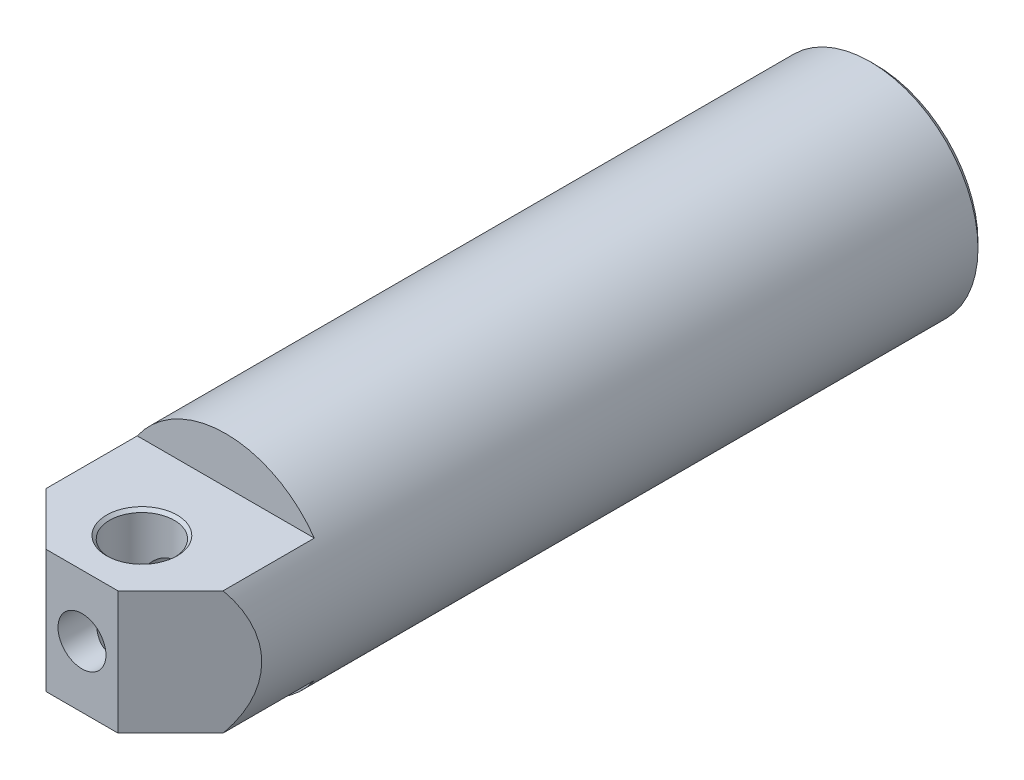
ISO-10303-21;
HEADER;
FILE_DESCRIPTION(('STEP AP214'),'2;1');
FILE_NAME('part.step','',(''),(''),'','','');
FILE_SCHEMA(('AUTOMOTIVE_DESIGN { 1 0 10303 214 1 1 1 1 }'));
ENDSEC;
DATA;
#1=APPLICATION_CONTEXT('core data for automotive mechanical design processes');
#2=APPLICATION_PROTOCOL_DEFINITION('international standard','automotive_design',2000,#1);
#3=PRODUCT_CONTEXT('',#1,'mechanical');
#4=PRODUCT('Part','Part','',(#3));
#5=PRODUCT_RELATED_PRODUCT_CATEGORY('part','',(#4));
#6=PRODUCT_DEFINITION_FORMATION('','',#4);
#7=PRODUCT_DEFINITION_CONTEXT('part definition',#1,'design');
#8=PRODUCT_DEFINITION('design','',#6,#7);
#9=PRODUCT_DEFINITION_SHAPE('','',#8);
#10=(LENGTH_UNIT() NAMED_UNIT(*) SI_UNIT(.MILLI.,.METRE.));
#11=(NAMED_UNIT(*) PLANE_ANGLE_UNIT() SI_UNIT($,.RADIAN.));
#12=(NAMED_UNIT(*) SI_UNIT($,.STERADIAN.) SOLID_ANGLE_UNIT());
#13=UNCERTAINTY_MEASURE_WITH_UNIT(LENGTH_MEASURE(1.E-05),#10,'distance_accuracy_value','');
#14=(GEOMETRIC_REPRESENTATION_CONTEXT(3) GLOBAL_UNCERTAINTY_ASSIGNED_CONTEXT((#13)) GLOBAL_UNIT_ASSIGNED_CONTEXT((#10,
#11,#12)) REPRESENTATION_CONTEXT('',''));
#15=CARTESIAN_POINT('',(0.,0.,0.));
#16=DIRECTION('',(0.,0.,1.));
#17=DIRECTION('',(1.,0.,0.));
#18=AXIS2_PLACEMENT_3D('',#15,#16,#17);
#19=CARTESIAN_POINT('',(0.,0.,0.));
#20=DIRECTION('',(0.,0.,1.));
#21=DIRECTION('',(1.,0.,0.));
#22=AXIS2_PLACEMENT_3D('',#19,#20,#21);
#23=CYLINDRICAL_SURFACE('',#22,28.575);
#24=CARTESIAN_POINT('',(0.,0.,-208.787499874));
#25=DIRECTION('',(0.,0.,1.));
#26=DIRECTION('',(1.,0.,0.));
#27=AXIS2_PLACEMENT_3D('',#24,#25,#26);
#28=CIRCLE('',#27,28.575);
#29=CARTESIAN_POINT('',(28.575,0.,-208.787499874));
#30=VERTEX_POINT('',#29);
#31=EDGE_CURVE('E185',#30,#30,#28,.T.);
#32=ORIENTED_EDGE('',*,*,#31,.T.);
#33=EDGE_LOOP('',(#32));
#34=FACE_BOUND('',#33,.T.);
#35=DIRECTION('',(0.,0.,1.));
#36=VECTOR('',#35,1.);
#37=CARTESIAN_POINT('',(4.063500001,-28.2845999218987,0.));
#38=LINE('',#37,#36);
#39=CARTESIAN_POINT('',(4.063500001,-28.2845999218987,-121.474999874));
#40=VERTEX_POINT('',#39);
#41=CARTESIAN_POINT('',(4.063500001,-28.2845999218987,-169.099999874));
#42=VERTEX_POINT('',#41);
#43=EDGE_CURVE('E113',#40,#42,#38,.F.);
#44=ORIENTED_EDGE('',*,*,#43,.T.);
#45=CARTESIAN_POINT('',(4.063500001,-28.2845999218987,-169.099999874));
#46=CARTESIAN_POINT('',(4.06351162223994,-28.2845931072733,-169.213674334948));
#47=CARTESIAN_POINT('',(4.05873010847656,-28.2852850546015,-169.327342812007));
#48=CARTESIAN_POINT('',(4.03967085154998,-28.2880160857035,-169.553855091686));
#49=CARTESIAN_POINT('',(4.02539392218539,-28.2900550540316,-169.66669896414));
#50=CARTESIAN_POINT('',(3.98745504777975,-28.295426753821,-169.890643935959));
#51=CARTESIAN_POINT('',(3.96380360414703,-28.2987580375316,-170.001746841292));
#52=CARTESIAN_POINT('',(3.90731643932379,-28.3066124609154,-170.221517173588));
#53=CARTESIAN_POINT('',(3.87448075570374,-28.3111355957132,-170.330184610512));
#54=CARTESIAN_POINT('',(3.76249372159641,-28.3263133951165,-170.651449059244));
#55=CARTESIAN_POINT('',(3.66983916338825,-28.3385799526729,-170.859444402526));
#56=CARTESIAN_POINT('',(3.45133010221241,-28.3660181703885,-171.256813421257));
#57=CARTESIAN_POINT('',(3.32547704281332,-28.381189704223,-171.446187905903));
#58=CARTESIAN_POINT('',(3.04315542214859,-28.4128506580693,-171.802440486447));
#59=CARTESIAN_POINT('',(2.88649781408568,-28.4293478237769,-171.969168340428));
#60=CARTESIAN_POINT('',(2.54741286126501,-28.4617333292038,-172.274070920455));
#61=CARTESIAN_POINT('',(2.36498158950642,-28.4776215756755,-172.412241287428));
#62=CARTESIAN_POINT('',(1.97856753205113,-28.5070788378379,-172.656652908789));
#63=CARTESIAN_POINT('',(1.77449573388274,-28.52063762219,-172.762754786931));
#64=CARTESIAN_POINT('',(1.35121589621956,-28.5438209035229,-172.939115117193));
#65=CARTESIAN_POINT('',(1.13200946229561,-28.5534458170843,-173.009377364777));
#66=CARTESIAN_POINT('',(0.686239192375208,-28.5676227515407,-173.111613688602));
#67=CARTESIAN_POINT('',(0.459734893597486,-28.5722085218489,-173.143842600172));
#68=CARTESIAN_POINT('',(0.00448434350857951,-28.575906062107,-173.169888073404));
#69=CARTESIAN_POINT('',(-0.224261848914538,-28.5750179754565,-173.163705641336));
#70=CARTESIAN_POINT('',(-0.675753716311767,-28.5678947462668,-173.11330491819));
#71=CARTESIAN_POINT('',(-0.898530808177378,-28.561698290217,-173.069361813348));
#72=CARTESIAN_POINT('',(-1.3335153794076,-28.5446977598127,-172.94511801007));
#73=CARTESIAN_POINT('',(-1.54572267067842,-28.5338936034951,-172.864816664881));
#74=CARTESIAN_POINT('',(-1.95438709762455,-28.5088248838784,-172.669851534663));
#75=CARTESIAN_POINT('',(-2.15078739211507,-28.4945485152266,-172.555070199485));
#76=CARTESIAN_POINT('',(-2.52163782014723,-28.4641289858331,-172.294483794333));
#77=CARTESIAN_POINT('',(-2.69608753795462,-28.4479857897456,-172.148678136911));
#78=CARTESIAN_POINT('',(-3.01967762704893,-28.4154693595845,-171.828705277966));
#79=CARTESIAN_POINT('',(-3.16858412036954,-28.3990953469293,-171.654301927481));
#80=CARTESIAN_POINT('',(-3.43513436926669,-28.3680906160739,-171.282683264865));
#81=CARTESIAN_POINT('',(-3.55276899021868,-28.3534604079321,-171.085461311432));
#82=CARTESIAN_POINT('',(-3.70315656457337,-28.334074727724,-170.776857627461));
#83=CARTESIAN_POINT('',(-3.74897963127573,-28.3280339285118,-170.671731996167));
#84=CARTESIAN_POINT('',(-3.83159364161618,-28.3169782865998,-170.457949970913));
#85=CARTESIAN_POINT('',(-3.86838804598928,-28.3119630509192,-170.349294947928));
#86=CARTESIAN_POINT('',(-3.93263253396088,-28.3031107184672,-170.129346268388));
#87=CARTESIAN_POINT('',(-3.9600925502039,-28.2992723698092,-170.018055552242));
#88=CARTESIAN_POINT('',(-4.00551014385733,-28.2928796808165,-169.793559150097));
#89=CARTESIAN_POINT('',(-4.02347230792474,-28.2903247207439,-169.680354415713));
#90=CARTESIAN_POINT('',(-4.04557910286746,-28.2871701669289,-169.489113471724));
#91=CARTESIAN_POINT('',(-4.05230324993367,-28.2862068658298,-169.411371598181));
#92=CARTESIAN_POINT('',(-4.06126075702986,-28.2849216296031,-169.255755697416));
#93=CARTESIAN_POINT('',(-4.06350165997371,-28.2845986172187,-169.177882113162));
#94=CARTESIAN_POINT('',(-4.063500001,-28.2845999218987,-169.099999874));
#95=B_SPLINE_CURVE_WITH_KNOTS('',3,(#45,#46,#47,#48,#49,#50,#51,#52,#53,#54,#55,#56,#57,#58,#59,
#60,#61,#62,#63,#64,#65,#66,#67,#68,#69,#70,#71,#72,#73,#74,#75,#76,#77,#78,#79,#80,#81,#82,#83,
#84,#85,#86,#87,#88,#89,#90,#91,#92,#93,#94),.UNSPECIFIED.,.F.,.F.,(4,2,2,2,2,2,2,2,2,2,2,2,2,2,
2,2,2,2,2,2,2,2,2,2,4),(0.,0.340910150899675,0.681791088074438,1.02229124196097,
1.36279000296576,2.04337813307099,2.72393667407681,3.40881003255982,4.09378785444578,
4.78170128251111,5.46954184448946,6.15274700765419,6.83593427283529,7.51418453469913,
8.19244686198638,8.87304830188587,9.5536626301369,10.2402098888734,10.9269574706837,
11.2711299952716,11.615170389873,11.9588435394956,12.3023505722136,12.5363412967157,
12.7699380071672),.UNSPECIFIED.);
#96=CARTESIAN_POINT('',(-4.063500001,-28.2845999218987,-169.099999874));
#97=VERTEX_POINT('',#96);
#98=EDGE_CURVE('E122',#42,#97,#95,.T.);
#99=ORIENTED_EDGE('',*,*,#98,.T.);
#100=DIRECTION('',(0.,0.,1.));
#101=VECTOR('',#100,1.);
#102=CARTESIAN_POINT('',(-4.063500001,-28.2845999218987,0.));
#103=LINE('',#102,#101);
#104=CARTESIAN_POINT('',(-4.063500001,-28.2845999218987,-121.474999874));
#105=VERTEX_POINT('',#104);
#106=EDGE_CURVE('E115',#97,#105,#103,.T.);
#107=ORIENTED_EDGE('',*,*,#106,.T.);
#108=CARTESIAN_POINT('',(-4.063500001,-28.2845999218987,-121.474999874));
#109=CARTESIAN_POINT('',(-4.06351162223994,-28.2845931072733,-121.361325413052));
#110=CARTESIAN_POINT('',(-4.05873010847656,-28.2852850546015,-121.247656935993));
#111=CARTESIAN_POINT('',(-4.03967085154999,-28.2880160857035,-121.021144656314));
#112=CARTESIAN_POINT('',(-4.0253939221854,-28.2900550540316,-120.90830078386));
#113=CARTESIAN_POINT('',(-3.98745504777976,-28.295426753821,-120.684355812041));
#114=CARTESIAN_POINT('',(-3.96380360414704,-28.2987580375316,-120.573252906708));
#115=CARTESIAN_POINT('',(-3.9073164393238,-28.3066124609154,-120.353482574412));
#116=CARTESIAN_POINT('',(-3.87448075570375,-28.3111355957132,-120.244815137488));
#117=CARTESIAN_POINT('',(-3.76249372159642,-28.3263133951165,-119.923550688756));
#118=CARTESIAN_POINT('',(-3.66983916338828,-28.3385799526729,-119.715555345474));
#119=CARTESIAN_POINT('',(-3.45133010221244,-28.3660181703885,-119.318186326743));
#120=CARTESIAN_POINT('',(-3.32547704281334,-28.381189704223,-119.128811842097));
#121=CARTESIAN_POINT('',(-3.04315542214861,-28.4128506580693,-118.772559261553));
#122=CARTESIAN_POINT('',(-2.88649781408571,-28.4293478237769,-118.605831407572));
#123=CARTESIAN_POINT('',(-2.54741286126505,-28.4617333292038,-118.300928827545));
#124=CARTESIAN_POINT('',(-2.36498158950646,-28.4776215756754,-118.162758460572));
#125=CARTESIAN_POINT('',(-1.97856753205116,-28.5070788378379,-117.918346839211));
#126=CARTESIAN_POINT('',(-1.77449573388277,-28.52063762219,-117.812244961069));
#127=CARTESIAN_POINT('',(-1.35121589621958,-28.5438209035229,-117.635884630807));
#128=CARTESIAN_POINT('',(-1.13200946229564,-28.5534458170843,-117.565622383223));
#129=CARTESIAN_POINT('',(-0.686239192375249,-28.5676227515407,-117.463386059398));
#130=CARTESIAN_POINT('',(-0.459734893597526,-28.5722085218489,-117.431157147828));
#131=CARTESIAN_POINT('',(-0.00448434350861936,-28.575906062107,-117.405111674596));
#132=CARTESIAN_POINT('',(0.224261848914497,-28.5750179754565,-117.411294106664));
#133=CARTESIAN_POINT('',(0.675753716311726,-28.5678947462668,-117.46169482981));
#134=CARTESIAN_POINT('',(0.898530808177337,-28.561698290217,-117.505637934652));
#135=CARTESIAN_POINT('',(1.33351537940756,-28.5446977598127,-117.62988173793));
#136=CARTESIAN_POINT('',(1.54572267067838,-28.5338936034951,-117.710183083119));
#137=CARTESIAN_POINT('',(1.95438709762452,-28.5088248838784,-117.905148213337));
#138=CARTESIAN_POINT('',(2.15078739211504,-28.4945485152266,-118.019929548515));
#139=CARTESIAN_POINT('',(2.5216378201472,-28.4641289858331,-118.280515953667));
#140=CARTESIAN_POINT('',(2.69608753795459,-28.4479857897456,-118.426321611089));
#141=CARTESIAN_POINT('',(3.01967762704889,-28.4154693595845,-118.746294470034));
#142=CARTESIAN_POINT('',(3.1685841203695,-28.3990953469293,-118.920697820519));
#143=CARTESIAN_POINT('',(3.43513436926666,-28.3680906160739,-119.292316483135));
#144=CARTESIAN_POINT('',(3.55276899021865,-28.3534604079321,-119.489538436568));
#145=CARTESIAN_POINT('',(3.70315656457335,-28.334074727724,-119.798142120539));
#146=CARTESIAN_POINT('',(3.7489796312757,-28.3280339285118,-119.903267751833));
#147=CARTESIAN_POINT('',(3.83159364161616,-28.3169782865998,-120.117049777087));
#148=CARTESIAN_POINT('',(3.86838804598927,-28.3119630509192,-120.225704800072));
#149=CARTESIAN_POINT('',(3.93263253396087,-28.3031107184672,-120.445653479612));
#150=CARTESIAN_POINT('',(3.96009255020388,-28.2992723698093,-120.556944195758));
#151=CARTESIAN_POINT('',(4.00551014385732,-28.2928796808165,-120.781440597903));
#152=CARTESIAN_POINT('',(4.02347230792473,-28.2903247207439,-120.894645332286));
#153=CARTESIAN_POINT('',(4.04557910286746,-28.2871701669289,-121.085886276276));
#154=CARTESIAN_POINT('',(4.05230324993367,-28.2862068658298,-121.163628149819));
#155=CARTESIAN_POINT('',(4.06126075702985,-28.2849216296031,-121.319244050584));
#156=CARTESIAN_POINT('',(4.06350165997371,-28.2845986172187,-121.397117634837));
#157=CARTESIAN_POINT('',(4.063500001,-28.2845999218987,-121.474999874));
#158=B_SPLINE_CURVE_WITH_KNOTS('',3,(#108,#109,#110,#111,#112,#113,#114,#115,#116,#117,#118,
#119,#120,#121,#122,#123,#124,#125,#126,#127,#128,#129,#130,#131,#132,#133,#134,#135,#136,#137,
#138,#139,#140,#141,#142,#143,#144,#145,#146,#147,#148,#149,#150,#151,#152,#153,#154,#155,#156,
#157),.UNSPECIFIED.,.F.,.F.,(4,2,2,2,2,2,2,2,2,2,2,2,2,2,2,2,2,2,2,2,2,2,2,2,4),(0.,
0.340910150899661,0.681791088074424,1.02229124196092,1.36279000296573,2.04337813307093,
2.72393667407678,3.40881003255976,4.09378785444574,4.78170128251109,5.46954184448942,
6.15274700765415,6.83593427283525,7.51418453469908,8.19244686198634,8.87304830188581,
9.55366263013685,10.2402098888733,10.9269574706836,11.2711299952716,11.615170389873,
11.9588435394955,12.3023505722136,12.5363412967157,12.7699380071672),.UNSPECIFIED.);
#159=EDGE_CURVE('E111',#105,#40,#158,.T.);
#160=ORIENTED_EDGE('',*,*,#159,.T.);
#161=EDGE_LOOP('',(#44,#99,#107,#160));
#162=FACE_BOUND('',#161,.T.);
#163=DIRECTION('',(0.,0.,1.));
#164=VECTOR('',#163,1.);
#165=CARTESIAN_POINT('',(23.4540038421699,16.322999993,0.));
#166=LINE('',#165,#164);
#167=CARTESIAN_POINT('',(23.4540038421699,16.322999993,-13.9290038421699));
#168=VERTEX_POINT('',#167);
#169=CARTESIAN_POINT('',(23.4540038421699,16.322999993,-38.1));
#170=VERTEX_POINT('',#169);
#171=EDGE_CURVE('E216',#168,#170,#166,.F.);
#172=ORIENTED_EDGE('',*,*,#171,.F.);
#173=CARTESIAN_POINT('',(0.,0.,9.52500000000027));
#174=DIRECTION('',(-0.707106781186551,0.,-0.707106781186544));
#175=DIRECTION('',(-0.707106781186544,0.,0.707106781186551));
#176=AXIS2_PLACEMENT_3D('',#173,#174,#175);
#177=ELLIPSE('',#176,40.4111525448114,28.575);
#178=CARTESIAN_POINT('',(23.4540038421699,-16.322999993,-13.9290038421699));
#179=VERTEX_POINT('',#178);
#180=EDGE_CURVE('E201',#168,#179,#177,.T.);
#181=ORIENTED_EDGE('',*,*,#180,.T.);
#182=DIRECTION('',(0.,0.,1.));
#183=VECTOR('',#182,1.);
#184=CARTESIAN_POINT('',(23.4540038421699,-16.322999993,0.));
#185=LINE('',#184,#183);
#186=CARTESIAN_POINT('',(23.4540038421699,-16.322999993,-38.1));
#187=VERTEX_POINT('',#186);
#188=EDGE_CURVE('E223',#187,#179,#185,.T.);
#189=ORIENTED_EDGE('',*,*,#188,.F.);
#190=CARTESIAN_POINT('',(0.,0.,-38.1));
#191=DIRECTION('',(0.,0.,1.));
#192=DIRECTION('',(1.,0.,0.));
#193=AXIS2_PLACEMENT_3D('',#190,#191,#192);
#194=CIRCLE('',#193,28.575);
#195=CARTESIAN_POINT('',(-23.4540038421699,-16.322999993,-38.1));
#196=VERTEX_POINT('',#195);
#197=EDGE_CURVE('E266',#196,#187,#194,.T.);
#198=ORIENTED_EDGE('',*,*,#197,.F.);
#199=DIRECTION('',(0.,0.,1.));
#200=VECTOR('',#199,1.);
#201=CARTESIAN_POINT('',(-23.4540038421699,-16.322999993,0.));
#202=LINE('',#201,#200);
#203=CARTESIAN_POINT('',(-23.4540038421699,-16.322999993,-13.9290038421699));
#204=VERTEX_POINT('',#203);
#205=EDGE_CURVE('E221',#204,#196,#202,.F.);
#206=ORIENTED_EDGE('',*,*,#205,.F.);
#207=CARTESIAN_POINT('',(0.,0.,9.52500000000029));
#208=DIRECTION('',(0.707106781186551,0.,-0.707106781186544));
#209=DIRECTION('',(0.707106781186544,0.,0.707106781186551));
#210=AXIS2_PLACEMENT_3D('',#207,#208,#209);
#211=ELLIPSE('',#210,40.4111525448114,28.575);
#212=CARTESIAN_POINT('',(-23.4540038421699,16.322999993,-13.9290038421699));
#213=VERTEX_POINT('',#212);
#214=EDGE_CURVE('E208',#204,#213,#211,.T.);
#215=ORIENTED_EDGE('',*,*,#214,.T.);
#216=DIRECTION('',(0.,0.,1.));
#217=VECTOR('',#216,1.);
#218=CARTESIAN_POINT('',(-23.4540038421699,16.322999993,0.));
#219=LINE('',#218,#217);
#220=CARTESIAN_POINT('',(-23.4540038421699,16.322999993,-38.1));
#221=VERTEX_POINT('',#220);
#222=EDGE_CURVE('E218',#221,#213,#219,.T.);
#223=ORIENTED_EDGE('',*,*,#222,.F.);
#224=EDGE_CURVE('E264',#170,#221,#194,.T.);
#225=ORIENTED_EDGE('',*,*,#224,.F.);
#226=EDGE_LOOP('',(#172,#181,#189,#198,#206,#215,#223,#225));
#227=FACE_BOUND('',#226,.T.);
#228=ADVANCED_FACE('F34',(#34,#162,#227),#23,.T.);
#229=CARTESIAN_POINT('',(0.,28.575,0.));
#230=DIRECTION('',(0.,0.,-1.));
#231=DIRECTION('',(-1.,0.,0.));
#232=AXIS2_PLACEMENT_3D('',#229,#230,#231);
#233=PLANE('',#232);
#234=CARTESIAN_POINT('',(0.,0.,0.));
#235=DIRECTION('',(0.,0.,1.));
#236=DIRECTION('',(1.,0.,0.));
#237=AXIS2_PLACEMENT_3D('',#234,#235,#236);
#238=CIRCLE('',#237,6.35);
#239=CARTESIAN_POINT('',(6.35,0.,0.));
#240=VERTEX_POINT('',#239);
#241=EDGE_CURVE('E280',#240,#240,#238,.T.);
#242=ORIENTED_EDGE('',*,*,#241,.F.);
#243=EDGE_LOOP('',(#242));
#244=FACE_BOUND('',#243,.T.);
#245=DIRECTION('',(-1.,0.,0.));
#246=VECTOR('',#245,1.);
#247=CARTESIAN_POINT('',(0.,-16.322999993,0.));
#248=LINE('',#247,#246);
#249=CARTESIAN_POINT('',(9.52500000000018,-16.322999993,0.));
#250=VERTEX_POINT('',#249);
#251=CARTESIAN_POINT('',(-9.52500000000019,-16.322999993,0.));
#252=VERTEX_POINT('',#251);
#253=EDGE_CURVE('E262',#250,#252,#248,.T.);
#254=ORIENTED_EDGE('',*,*,#253,.F.);
#255=DIRECTION('',(0.,1.,0.));
#256=VECTOR('',#255,1.);
#257=CARTESIAN_POINT('',(9.52500000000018,-28.575,0.));
#258=LINE('',#257,#256);
#259=CARTESIAN_POINT('',(9.52500000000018,16.322999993,0.));
#260=VERTEX_POINT('',#259);
#261=EDGE_CURVE('E198',#250,#260,#258,.T.);
#262=ORIENTED_EDGE('',*,*,#261,.T.);
#263=DIRECTION('',(1.,0.,0.));
#264=VECTOR('',#263,1.);
#265=CARTESIAN_POINT('',(0.,16.322999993,0.));
#266=LINE('',#265,#264);
#267=CARTESIAN_POINT('',(-9.52500000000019,16.322999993,0.));
#268=VERTEX_POINT('',#267);
#269=EDGE_CURVE('E259',#268,#260,#266,.T.);
#270=ORIENTED_EDGE('',*,*,#269,.F.);
#271=DIRECTION('',(0.,1.,0.));
#272=VECTOR('',#271,1.);
#273=CARTESIAN_POINT('',(-9.52500000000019,-28.575,0.));
#274=LINE('',#273,#272);
#275=EDGE_CURVE('E206',#252,#268,#274,.T.);
#276=ORIENTED_EDGE('',*,*,#275,.F.);
#277=EDGE_LOOP('',(#254,#262,#270,#276));
#278=FACE_BOUND('',#277,.T.);
#279=ADVANCED_FACE('F317',(#244,#278),#233,.F.);
#280=CARTESIAN_POINT('',(0.,0.,-38.7268026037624));
#281=DIRECTION('',(0.,0.,-1.));
#282=DIRECTION('',(-1.,0.,0.));
#283=AXIS2_PLACEMENT_3D('',#280,#281,#282);
#284=CONICAL_SURFACE('',#283,0.,1.02974425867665);
#285=CARTESIAN_POINT('',(0.,0.,-42.5422675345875));
#286=DIRECTION('',(0.,0.,-1.));
#287=DIRECTION('',(-1.,0.,0.));
#288=AXIS2_PLACEMENT_3D('',#285,#286,#287);
#289=CIRCLE('',#288,6.35);
#290=CARTESIAN_POINT('',(-6.35,0.,-42.5422675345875));
#291=VERTEX_POINT('',#290);
#292=EDGE_CURVE('E129',#291,#291,#289,.F.);
#293=ORIENTED_EDGE('',*,*,#292,.T.);
#294=EDGE_LOOP('',(#293));
#295=FACE_BOUND('',#294,.T.);
#296=CARTESIAN_POINT('',(0.,0.,-44.45));
#297=DIRECTION('',(0.,0.,1.));
#298=DIRECTION('',(1.,0.,0.));
#299=AXIS2_PLACEMENT_3D('',#296,#297,#298);
#300=CIRCLE('',#299,9.525);
#301=CARTESIAN_POINT('',(9.525,0.,-44.45));
#302=VERTEX_POINT('',#301);
#303=EDGE_CURVE('E256',#302,#302,#300,.T.);
#304=ORIENTED_EDGE('',*,*,#303,.F.);
#305=EDGE_LOOP('',(#304));
#306=FACE_BOUND('',#305,.T.);
#307=ADVANCED_FACE('F322',(#295,#306),#284,.F.);
#308=CARTESIAN_POINT('',(0.,9.525,-44.45));
#309=DIRECTION('',(0.,0.,1.));
#310=DIRECTION('',(1.,0.,0.));
#311=AXIS2_PLACEMENT_3D('',#308,#309,#310);
#312=PLANE('',#311);
#313=CARTESIAN_POINT('',(0.,0.,-44.45));
#314=DIRECTION('',(0.,0.,1.));
#315=DIRECTION('',(1.,0.,0.));
#316=AXIS2_PLACEMENT_3D('',#313,#314,#315);
#317=CIRCLE('',#316,19.05);
#318=CARTESIAN_POINT('',(19.05,0.,-44.45));
#319=VERTEX_POINT('',#318);
#320=EDGE_CURVE('E253',#319,#319,#317,.T.);
#321=ORIENTED_EDGE('',*,*,#320,.F.);
#322=EDGE_LOOP('',(#321));
#323=FACE_BOUND('',#322,.T.);
#324=ORIENTED_EDGE('',*,*,#303,.T.);
#325=EDGE_LOOP('',(#324));
#326=FACE_BOUND('',#325,.T.);
#327=ADVANCED_FACE('F414',(#323,#326),#312,.F.);
#328=CARTESIAN_POINT('',(0.,0.,0.));
#329=DIRECTION('',(0.,0.,1.));
#330=DIRECTION('',(1.,0.,0.));
#331=AXIS2_PLACEMENT_3D('',#328,#329,#330);
#332=CYLINDRICAL_SURFACE('',#331,19.05);
#333=CARTESIAN_POINT('',(0.,0.,-107.187499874));
#334=DIRECTION('',(0.,0.,1.));
#335=DIRECTION('',(1.,0.,0.));
#336=AXIS2_PLACEMENT_3D('',#333,#334,#335);
#337=CIRCLE('',#336,19.05);
#338=CARTESIAN_POINT('',(19.05,0.,-107.187499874));
#339=VERTEX_POINT('',#338);
#340=EDGE_CURVE('E333',#339,#339,#337,.F.);
#341=ORIENTED_EDGE('',*,*,#340,.T.);
#342=EDGE_LOOP('',(#341));
#343=FACE_BOUND('',#342,.T.);
#344=ORIENTED_EDGE('',*,*,#320,.T.);
#345=EDGE_LOOP('',(#344));
#346=FACE_BOUND('',#345,.T.);
#347=ADVANCED_FACE('F409',(#343,#346),#332,.F.);
#348=CARTESIAN_POINT('',(0.,19.05,-108.774999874));
#349=DIRECTION('',(0.,0.,1.));
#350=DIRECTION('',(1.,0.,0.));
#351=AXIS2_PLACEMENT_3D('',#348,#349,#350);
#352=PLANE('',#351);
#353=CARTESIAN_POINT('',(0.,0.,-108.774999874));
#354=DIRECTION('',(0.,0.,1.));
#355=DIRECTION('',(1.,0.,0.));
#356=AXIS2_PLACEMENT_3D('',#353,#354,#355);
#357=CIRCLE('',#356,19.9665435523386);
#358=CARTESIAN_POINT('',(19.9665435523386,0.,-108.774999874));
#359=VERTEX_POINT('',#358);
#360=EDGE_CURVE('E329',#359,#359,#357,.T.);
#361=ORIENTED_EDGE('',*,*,#360,.T.);
#362=EDGE_LOOP('',(#361));
#363=FACE_BOUND('',#362,.T.);
#364=CARTESIAN_POINT('',(0.,0.,-108.774999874));
#365=DIRECTION('',(0.,0.,1.));
#366=DIRECTION('',(1.,0.,0.));
#367=AXIS2_PLACEMENT_3D('',#364,#365,#366);
#368=CIRCLE('',#367,22.225);
#369=CARTESIAN_POINT('',(22.225,0.,-108.774999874));
#370=VERTEX_POINT('',#369);
#371=EDGE_CURVE('E250',#370,#370,#368,.T.);
#372=ORIENTED_EDGE('',*,*,#371,.F.);
#373=EDGE_LOOP('',(#372));
#374=FACE_BOUND('',#373,.T.);
#375=ADVANCED_FACE('F176',(#363,#374),#352,.F.);
#376=CARTESIAN_POINT('',(0.,0.,0.));
#377=DIRECTION('',(0.,0.,1.));
#378=DIRECTION('',(1.,0.,0.));
#379=AXIS2_PLACEMENT_3D('',#376,#377,#378);
#380=CYLINDRICAL_SURFACE('',#379,22.225);
#381=DIRECTION('',(0.,0.,1.));
#382=VECTOR('',#381,1.);
#383=CARTESIAN_POINT('',(4.063500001,-21.8503682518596,0.));
#384=LINE('',#383,#382);
#385=CARTESIAN_POINT('',(4.063500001,-21.8503682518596,-169.099999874));
#386=VERTEX_POINT('',#385);
#387=CARTESIAN_POINT('',(4.063500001,-21.8503682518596,-121.474999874));
#388=VERTEX_POINT('',#387);
#389=EDGE_CURVE('E167',#386,#388,#384,.T.);
#390=ORIENTED_EDGE('',*,*,#389,.T.);
#391=CARTESIAN_POINT('',(4.063500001,-21.8503682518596,-121.474999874));
#392=CARTESIAN_POINT('',(4.06351205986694,-21.8503593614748,-121.361729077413));
#393=CARTESIAN_POINT('',(4.05876395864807,-21.851248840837,-121.248464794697));
#394=CARTESIAN_POINT('',(4.03984093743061,-21.8547587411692,-121.022765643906));
#395=CARTESIAN_POINT('',(4.02566706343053,-21.857378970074,-120.910330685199));
#396=CARTESIAN_POINT('',(3.98801207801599,-21.8642798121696,-120.687235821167));
#397=CARTESIAN_POINT('',(3.96454389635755,-21.8685581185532,-120.576573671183));
#398=CARTESIAN_POINT('',(3.9085052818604,-21.8786428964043,-120.357681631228));
#399=CARTESIAN_POINT('',(3.875934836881,-21.8844493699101,-120.2494517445));
#400=CARTESIAN_POINT('',(3.76488370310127,-21.9039268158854,-119.929512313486));
#401=CARTESIAN_POINT('',(3.67303550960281,-21.9196612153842,-119.72239005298));
#402=CARTESIAN_POINT('',(3.4564942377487,-21.9548451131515,-119.326592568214));
#403=CARTESIAN_POINT('',(3.33179935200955,-21.9742948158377,-119.137918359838));
#404=CARTESIAN_POINT('',(3.05151580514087,-22.014974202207,-118.782029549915));
#405=CARTESIAN_POINT('',(2.89561679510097,-22.0362204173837,-118.615060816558));
#406=CARTESIAN_POINT('',(2.55801343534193,-22.0779543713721,-118.309489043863));
#407=CARTESIAN_POINT('',(2.37630511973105,-22.0984419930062,-118.170890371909));
#408=CARTESIAN_POINT('',(1.99062276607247,-22.1365265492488,-117.925054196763));
#409=CARTESIAN_POINT('',(1.78649756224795,-22.1541015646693,-117.818050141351));
#410=CARTESIAN_POINT('',(1.36280475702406,-22.1841933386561,-117.639952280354));
#411=CARTESIAN_POINT('',(1.14323922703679,-22.1967107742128,-117.568853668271));
#412=CARTESIAN_POINT('',(0.697461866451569,-22.2151606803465,-117.46534195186));
#413=CARTESIAN_POINT('',(0.471350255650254,-22.2211643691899,-117.432510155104));
#414=CARTESIAN_POINT('',(0.0167482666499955,-22.2261556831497,-117.405160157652));
#415=CARTESIAN_POINT('',(-0.211741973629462,-22.2251437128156,-117.410639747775));
#416=CARTESIAN_POINT('',(-0.661734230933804,-22.2162732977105,-117.459435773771));
#417=CARTESIAN_POINT('',(-0.883287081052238,-22.2084966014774,-117.50230044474));
#418=CARTESIAN_POINT('',(-1.31600024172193,-22.1870621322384,-117.6239365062));
#419=CARTESIAN_POINT('',(-1.52716025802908,-22.1734041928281,-117.702708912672));
#420=CARTESIAN_POINT('',(-1.93441573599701,-22.1416044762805,-117.89435793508));
#421=CARTESIAN_POINT('',(-2.13042338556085,-22.1234388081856,-118.007417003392));
#422=CARTESIAN_POINT('',(-2.5008499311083,-22.0846351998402,-118.264301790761));
#423=CARTESIAN_POINT('',(-2.6752674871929,-22.0639971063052,-118.408129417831));
#424=CARTESIAN_POINT('',(-3.00020971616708,-22.0221851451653,-118.724903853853));
#425=CARTESIAN_POINT('',(-3.15035219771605,-22.0010078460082,-118.898241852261));
#426=CARTESIAN_POINT('',(-3.4195723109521,-21.9607777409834,-119.268012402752));
#427=CARTESIAN_POINT('',(-3.53864121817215,-21.9417255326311,-119.464451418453));
#428=CARTESIAN_POINT('',(-3.69133105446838,-21.9163716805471,-119.772257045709));
#429=CARTESIAN_POINT('',(-3.73796261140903,-21.9084477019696,-119.877229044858));
#430=CARTESIAN_POINT('',(-3.82219849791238,-21.89390912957,-120.090809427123));
#431=CARTESIAN_POINT('',(-3.85980633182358,-21.8872940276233,-120.199416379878));
#432=CARTESIAN_POINT('',(-3.92566730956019,-21.8755772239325,-120.419375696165));
#433=CARTESIAN_POINT('',(-3.95393025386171,-21.8704739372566,-120.530725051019));
#434=CARTESIAN_POINT('',(-4.00092788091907,-21.8619251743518,-120.755435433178));
#435=CARTESIAN_POINT('',(-4.01966711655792,-21.858478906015,-120.868795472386));
#436=CARTESIAN_POINT('',(-4.04354493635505,-21.8540722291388,-121.064447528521));
#437=CARTESIAN_POINT('',(-4.05103183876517,-21.8526843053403,-121.146451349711));
#438=CARTESIAN_POINT('',(-4.06100641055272,-21.8508319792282,-121.310634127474));
#439=CARTESIAN_POINT('',(-4.06350247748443,-21.850366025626,-121.39281255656));
#440=CARTESIAN_POINT('',(-4.063500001,-21.8503682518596,-121.474999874));
#441=B_SPLINE_CURVE_WITH_KNOTS('',3,(#391,#392,#393,#394,#395,#396,#397,#398,#399,#400,#401,
#402,#403,#404,#405,#406,#407,#408,#409,#410,#411,#412,#413,#414,#415,#416,#417,#418,#419,#420,
#421,#422,#423,#424,#425,#426,#427,#428,#429,#430,#431,#432,#433,#434,#435,#436,#437,#438,#439,
#440),.UNSPECIFIED.,.F.,.F.,(4,2,2,2,2,2,2,2,2,2,2,2,2,2,2,2,2,2,2,2,2,2,2,2,4),(0.,
0.33969799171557,0.679358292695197,1.01854772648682,1.35773761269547,2.03562751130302,
2.71355471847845,3.39859325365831,4.08373716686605,4.77382361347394,5.46381765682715,
6.14618914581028,6.82852128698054,7.50272054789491,8.17693888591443,8.85480989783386,
9.53272295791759,10.2204440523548,10.9083580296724,11.2534234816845,11.5983547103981,
11.9429230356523,12.2873264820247,12.534247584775,12.7807528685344),.UNSPECIFIED.);
#442=CARTESIAN_POINT('',(-4.063500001,-21.8503682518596,-121.474999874));
#443=VERTEX_POINT('',#442);
#444=EDGE_CURVE('E127',#388,#443,#441,.T.);
#445=ORIENTED_EDGE('',*,*,#444,.T.);
#446=DIRECTION('',(0.,0.,1.));
#447=VECTOR('',#446,1.);
#448=CARTESIAN_POINT('',(-4.063500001,-21.8503682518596,0.));
#449=LINE('',#448,#447);
#450=CARTESIAN_POINT('',(-4.063500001,-21.8503682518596,-169.099999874));
#451=VERTEX_POINT('',#450);
#452=EDGE_CURVE('E166',#443,#451,#449,.F.);
#453=ORIENTED_EDGE('',*,*,#452,.T.);
#454=CARTESIAN_POINT('',(-4.063500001,-21.8503682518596,-169.099999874));
#455=CARTESIAN_POINT('',(-4.06351205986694,-21.8503593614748,-169.213270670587));
#456=CARTESIAN_POINT('',(-4.05876395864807,-21.851248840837,-169.326534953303));
#457=CARTESIAN_POINT('',(-4.03984093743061,-21.8547587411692,-169.552234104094));
#458=CARTESIAN_POINT('',(-4.02566706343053,-21.857378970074,-169.664669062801));
#459=CARTESIAN_POINT('',(-3.988012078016,-21.8642798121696,-169.887763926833));
#460=CARTESIAN_POINT('',(-3.96454389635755,-21.8685581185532,-169.998426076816));
#461=CARTESIAN_POINT('',(-3.90850528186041,-21.8786428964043,-170.217318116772));
#462=CARTESIAN_POINT('',(-3.875934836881,-21.8844493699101,-170.3255480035));
#463=CARTESIAN_POINT('',(-3.76488370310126,-21.9039268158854,-170.645487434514));
#464=CARTESIAN_POINT('',(-3.6730355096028,-21.9196612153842,-170.85260969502));
#465=CARTESIAN_POINT('',(-3.45649423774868,-21.9548451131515,-171.248407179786));
#466=CARTESIAN_POINT('',(-3.33179935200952,-21.9742948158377,-171.437081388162));
#467=CARTESIAN_POINT('',(-3.05151580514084,-22.014974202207,-171.792970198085));
#468=CARTESIAN_POINT('',(-2.89561679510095,-22.0362204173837,-171.959938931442));
#469=CARTESIAN_POINT('',(-2.55801343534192,-22.0779543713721,-172.265510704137));
#470=CARTESIAN_POINT('',(-2.37630511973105,-22.0984419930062,-172.404109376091));
#471=CARTESIAN_POINT('',(-1.99062276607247,-22.1365265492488,-172.649945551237));
#472=CARTESIAN_POINT('',(-1.78649756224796,-22.1541015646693,-172.756949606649));
#473=CARTESIAN_POINT('',(-1.36280475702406,-22.184193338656,-172.935047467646));
#474=CARTESIAN_POINT('',(-1.14323922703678,-22.1967107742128,-173.006146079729));
#475=CARTESIAN_POINT('',(-0.697461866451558,-22.2151606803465,-173.10965779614));
#476=CARTESIAN_POINT('',(-0.471350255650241,-22.2211643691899,-173.142489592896));
#477=CARTESIAN_POINT('',(-0.0167482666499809,-22.2261556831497,-173.169839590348));
#478=CARTESIAN_POINT('',(0.211741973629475,-22.2251437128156,-173.164360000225));
#479=CARTESIAN_POINT('',(0.661734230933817,-22.2162732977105,-173.115563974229));
#480=CARTESIAN_POINT('',(0.883287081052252,-22.2084966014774,-173.07269930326));
#481=CARTESIAN_POINT('',(1.31600024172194,-22.1870621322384,-172.9510632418));
#482=CARTESIAN_POINT('',(1.52716025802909,-22.1734041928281,-172.872290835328));
#483=CARTESIAN_POINT('',(1.93441573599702,-22.1416044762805,-172.68064181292));
#484=CARTESIAN_POINT('',(2.13042338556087,-22.1234388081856,-172.567582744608));
#485=CARTESIAN_POINT('',(2.50084993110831,-22.0846351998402,-172.310697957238));
#486=CARTESIAN_POINT('',(2.67526748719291,-22.0639971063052,-172.166870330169));
#487=CARTESIAN_POINT('',(3.00020971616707,-22.0221851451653,-171.850095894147));
#488=CARTESIAN_POINT('',(3.15035219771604,-22.0010078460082,-171.676757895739));
#489=CARTESIAN_POINT('',(3.4195723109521,-21.9607777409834,-171.306987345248));
#490=CARTESIAN_POINT('',(3.53864121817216,-21.9417255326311,-171.110548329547));
#491=CARTESIAN_POINT('',(3.69133105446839,-21.9163716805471,-170.802742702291));
#492=CARTESIAN_POINT('',(3.73796261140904,-21.9084477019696,-170.697770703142));
#493=CARTESIAN_POINT('',(3.82219849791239,-21.89390912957,-170.484190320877));
#494=CARTESIAN_POINT('',(3.85980633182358,-21.8872940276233,-170.375583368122));
#495=CARTESIAN_POINT('',(3.92566730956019,-21.8755772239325,-170.155624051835));
#496=CARTESIAN_POINT('',(3.95393025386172,-21.8704739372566,-170.044274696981));
#497=CARTESIAN_POINT('',(4.00092788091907,-21.8619251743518,-169.819564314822));
#498=CARTESIAN_POINT('',(4.01966711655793,-21.858478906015,-169.706204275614));
#499=CARTESIAN_POINT('',(4.04354493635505,-21.8540722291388,-169.510552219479));
#500=CARTESIAN_POINT('',(4.05103183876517,-21.8526843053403,-169.428548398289));
#501=CARTESIAN_POINT('',(4.06100641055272,-21.8508319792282,-169.264365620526));
#502=CARTESIAN_POINT('',(4.06350247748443,-21.850366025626,-169.18218719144));
#503=CARTESIAN_POINT('',(4.063500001,-21.8503682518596,-169.099999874));
#504=B_SPLINE_CURVE_WITH_KNOTS('',3,(#454,#455,#456,#457,#458,#459,#460,#461,#462,#463,#464,
#465,#466,#467,#468,#469,#470,#471,#472,#473,#474,#475,#476,#477,#478,#479,#480,#481,#482,#483,
#484,#485,#486,#487,#488,#489,#490,#491,#492,#493,#494,#495,#496,#497,#498,#499,#500,#501,#502,
#503),.UNSPECIFIED.,.F.,.F.,(4,2,2,2,2,2,2,2,2,2,2,2,2,2,2,2,2,2,2,2,2,2,2,2,4),(0.,
0.339697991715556,0.679358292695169,1.01854772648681,1.35773761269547,2.03562751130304,
2.71355471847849,3.39859325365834,4.08373716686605,4.77382361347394,5.46381765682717,
6.14618914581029,6.82852128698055,7.50272054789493,8.17693888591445,8.85480989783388,
9.53272295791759,10.2204440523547,10.9083580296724,11.2534234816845,11.5983547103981,
11.9429230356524,12.2873264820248,12.534247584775,12.7807528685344),.UNSPECIFIED.);
#505=EDGE_CURVE('E158',#451,#386,#504,.T.);
#506=ORIENTED_EDGE('',*,*,#505,.T.);
#507=EDGE_LOOP('',(#390,#445,#453,#506));
#508=FACE_BOUND('',#507,.T.);
#509=CARTESIAN_POINT('',(0.,0.,-199.758299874));
#510=DIRECTION('',(0.,0.,1.));
#511=DIRECTION('',(1.,0.,0.));
#512=AXIS2_PLACEMENT_3D('',#509,#510,#511);
#513=CIRCLE('',#512,22.225);
#514=CARTESIAN_POINT('',(22.225,0.,-199.758299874));
#515=VERTEX_POINT('',#514);
#516=EDGE_CURVE('E247',#515,#515,#513,.T.);
#517=ORIENTED_EDGE('',*,*,#516,.F.);
#518=EDGE_LOOP('',(#517));
#519=FACE_BOUND('',#518,.T.);
#520=ORIENTED_EDGE('',*,*,#371,.T.);
#521=EDGE_LOOP('',(#520));
#522=FACE_BOUND('',#521,.T.);
#523=ADVANCED_FACE('F170',(#508,#519,#522),#380,.F.);
#524=CARTESIAN_POINT('',(0.,22.9489,-199.758299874));
#525=DIRECTION('',(0.,0.,1.));
#526=DIRECTION('',(1.,0.,0.));
#527=AXIS2_PLACEMENT_3D('',#524,#525,#526);
#528=PLANE('',#527);
#529=CARTESIAN_POINT('',(0.,0.,-199.758299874));
#530=DIRECTION('',(0.,0.,1.));
#531=DIRECTION('',(1.,0.,0.));
#532=AXIS2_PLACEMENT_3D('',#529,#530,#531);
#533=CIRCLE('',#532,22.9489);
#534=CARTESIAN_POINT('',(22.9489,0.,-199.758299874));
#535=VERTEX_POINT('',#534);
#536=EDGE_CURVE('E244',#535,#535,#533,.T.);
#537=ORIENTED_EDGE('',*,*,#536,.F.);
#538=EDGE_LOOP('',(#537));
#539=FACE_BOUND('',#538,.T.);
#540=ORIENTED_EDGE('',*,*,#516,.T.);
#541=EDGE_LOOP('',(#540));
#542=FACE_BOUND('',#541,.T.);
#543=ADVANCED_FACE('F175',(#539,#542),#528,.F.);
#544=CARTESIAN_POINT('',(0.,0.,0.));
#545=DIRECTION('',(0.,0.,1.));
#546=DIRECTION('',(1.,0.,0.));
#547=AXIS2_PLACEMENT_3D('',#544,#545,#546);
#548=CYLINDRICAL_SURFACE('',#547,22.9489);
#549=CARTESIAN_POINT('',(0.,0.,-200.786999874));
#550=DIRECTION('',(0.,0.,1.));
#551=DIRECTION('',(1.,0.,0.));
#552=AXIS2_PLACEMENT_3D('',#549,#550,#551);
#553=CIRCLE('',#552,22.9489);
#554=CARTESIAN_POINT('',(22.9489,0.,-200.786999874));
#555=VERTEX_POINT('',#554);
#556=EDGE_CURVE('E241',#555,#555,#553,.T.);
#557=ORIENTED_EDGE('',*,*,#556,.F.);
#558=EDGE_LOOP('',(#557));
#559=FACE_BOUND('',#558,.T.);
#560=ORIENTED_EDGE('',*,*,#536,.T.);
#561=EDGE_LOOP('',(#560));
#562=FACE_BOUND('',#561,.T.);
#563=ADVANCED_FACE('F394',(#559,#562),#548,.F.);
#564=CARTESIAN_POINT('',(0.,22.225,-200.786999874));
#565=DIRECTION('',(0.,0.,-1.));
#566=DIRECTION('',(-1.,0.,0.));
#567=AXIS2_PLACEMENT_3D('',#564,#565,#566);
#568=PLANE('',#567);
#569=CARTESIAN_POINT('',(0.,0.,-200.786999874));
#570=DIRECTION('',(0.,0.,1.));
#571=DIRECTION('',(1.,0.,0.));
#572=AXIS2_PLACEMENT_3D('',#569,#570,#571);
#573=CIRCLE('',#572,22.225);
#574=CARTESIAN_POINT('',(22.225,0.,-200.786999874));
#575=VERTEX_POINT('',#574);
#576=EDGE_CURVE('E238',#575,#575,#573,.T.);
#577=ORIENTED_EDGE('',*,*,#576,.F.);
#578=EDGE_LOOP('',(#577));
#579=FACE_BOUND('',#578,.T.);
#580=ORIENTED_EDGE('',*,*,#556,.T.);
#581=EDGE_LOOP('',(#580));
#582=FACE_BOUND('',#581,.T.);
#583=ADVANCED_FACE('F388',(#579,#582),#568,.F.);
#584=CARTESIAN_POINT('',(0.,0.,0.));
#585=DIRECTION('',(0.,0.,1.));
#586=DIRECTION('',(1.,0.,0.));
#587=AXIS2_PLACEMENT_3D('',#584,#585,#586);
#588=CYLINDRICAL_SURFACE('',#587,22.225);
#589=CARTESIAN_POINT('',(0.,0.,-204.786999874));
#590=DIRECTION('',(0.,0.,1.));
#591=DIRECTION('',(1.,0.,0.));
#592=AXIS2_PLACEMENT_3D('',#589,#590,#591);
#593=CIRCLE('',#592,22.225);
#594=CARTESIAN_POINT('',(22.225,0.,-204.786999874));
#595=VERTEX_POINT('',#594);
#596=EDGE_CURVE('E235',#595,#595,#593,.T.);
#597=ORIENTED_EDGE('',*,*,#596,.F.);
#598=EDGE_LOOP('',(#597));
#599=FACE_BOUND('',#598,.T.);
#600=ORIENTED_EDGE('',*,*,#576,.T.);
#601=EDGE_LOOP('',(#600));
#602=FACE_BOUND('',#601,.T.);
#603=ADVANCED_FACE('F382',(#599,#602),#588,.F.);
#604=CARTESIAN_POINT('',(0.,23.5966,-204.786999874));
#605=DIRECTION('',(0.,0.,1.));
#606=DIRECTION('',(1.,0.,0.));
#607=AXIS2_PLACEMENT_3D('',#604,#605,#606);
#608=PLANE('',#607);
#609=CARTESIAN_POINT('',(0.,0.,-204.786999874));
#610=DIRECTION('',(0.,0.,1.));
#611=DIRECTION('',(1.,0.,0.));
#612=AXIS2_PLACEMENT_3D('',#609,#610,#611);
#613=CIRCLE('',#612,23.5966);
#614=CARTESIAN_POINT('',(23.5966,0.,-204.786999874));
#615=VERTEX_POINT('',#614);
#616=EDGE_CURVE('E232',#615,#615,#613,.T.);
#617=ORIENTED_EDGE('',*,*,#616,.F.);
#618=EDGE_LOOP('',(#617));
#619=FACE_BOUND('',#618,.T.);
#620=ORIENTED_EDGE('',*,*,#596,.T.);
#621=EDGE_LOOP('',(#620));
#622=FACE_BOUND('',#621,.T.);
#623=ADVANCED_FACE('F376',(#619,#622),#608,.F.);
#624=CARTESIAN_POINT('',(0.,0.,0.));
#625=DIRECTION('',(0.,0.,1.));
#626=DIRECTION('',(1.,0.,0.));
#627=AXIS2_PLACEMENT_3D('',#624,#625,#626);
#628=CYLINDRICAL_SURFACE('',#627,23.5966);
#629=CARTESIAN_POINT('',(0.,0.,-206.564999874));
#630=DIRECTION('',(0.,0.,1.));
#631=DIRECTION('',(1.,0.,0.));
#632=AXIS2_PLACEMENT_3D('',#629,#630,#631);
#633=CIRCLE('',#632,23.5966);
#634=CARTESIAN_POINT('',(23.5966,0.,-206.564999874));
#635=VERTEX_POINT('',#634);
#636=EDGE_CURVE('E229',#635,#635,#633,.T.);
#637=ORIENTED_EDGE('',*,*,#636,.F.);
#638=EDGE_LOOP('',(#637));
#639=FACE_BOUND('',#638,.T.);
#640=ORIENTED_EDGE('',*,*,#616,.T.);
#641=EDGE_LOOP('',(#640));
#642=FACE_BOUND('',#641,.T.);
#643=ADVANCED_FACE('F370',(#639,#642),#628,.F.);
#644=CARTESIAN_POINT('',(0.,22.225,-206.564999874));
#645=DIRECTION('',(0.,0.,-1.));
#646=DIRECTION('',(-1.,0.,0.));
#647=AXIS2_PLACEMENT_3D('',#644,#645,#646);
#648=PLANE('',#647);
#649=CARTESIAN_POINT('',(0.,0.,-206.564999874));
#650=DIRECTION('',(0.,0.,1.));
#651=DIRECTION('',(1.,0.,0.));
#652=AXIS2_PLACEMENT_3D('',#649,#650,#651);
#653=CIRCLE('',#652,22.225);
#654=CARTESIAN_POINT('',(22.225,0.,-206.564999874));
#655=VERTEX_POINT('',#654);
#656=EDGE_CURVE('E226',#655,#655,#653,.T.);
#657=ORIENTED_EDGE('',*,*,#656,.F.);
#658=EDGE_LOOP('',(#657));
#659=FACE_BOUND('',#658,.T.);
#660=ORIENTED_EDGE('',*,*,#636,.T.);
#661=EDGE_LOOP('',(#660));
#662=FACE_BOUND('',#661,.T.);
#663=ADVANCED_FACE('F364',(#659,#662),#648,.F.);
#664=CARTESIAN_POINT('',(0.,0.,0.));
#665=DIRECTION('',(0.,0.,1.));
#666=DIRECTION('',(1.,0.,0.));
#667=AXIS2_PLACEMENT_3D('',#664,#665,#666);
#668=CYLINDRICAL_SURFACE('',#667,22.225);
#669=CARTESIAN_POINT('',(0.,0.,-208.787499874));
#670=DIRECTION('',(0.,0.,1.));
#671=DIRECTION('',(1.,0.,0.));
#672=AXIS2_PLACEMENT_3D('',#669,#670,#671);
#673=CIRCLE('',#672,22.225);
#674=CARTESIAN_POINT('',(22.225,0.,-208.787499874));
#675=VERTEX_POINT('',#674);
#676=EDGE_CURVE('E12',#675,#675,#673,.F.);
#677=ORIENTED_EDGE('',*,*,#676,.T.);
#678=EDGE_LOOP('',(#677));
#679=FACE_BOUND('',#678,.T.);
#680=ORIENTED_EDGE('',*,*,#656,.T.);
#681=EDGE_LOOP('',(#680));
#682=FACE_BOUND('',#681,.T.);
#683=ADVANCED_FACE('F361',(#679,#682),#668,.F.);
#684=CARTESIAN_POINT('',(0.,22.225,-210.374999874));
#685=DIRECTION('',(0.,0.,1.));
#686=DIRECTION('',(1.,0.,0.));
#687=AXIS2_PLACEMENT_3D('',#684,#685,#686);
#688=PLANE('',#687);
#689=CARTESIAN_POINT('',(0.,0.,-210.374999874));
#690=DIRECTION('',(0.,0.,1.));
#691=DIRECTION('',(1.,0.,0.));
#692=AXIS2_PLACEMENT_3D('',#689,#690,#691);
#693=CIRCLE('',#692,23.8125);
#694=CARTESIAN_POINT('',(23.8125,0.,-210.374999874));
#695=VERTEX_POINT('',#694);
#696=EDGE_CURVE('E42',#695,#695,#693,.T.);
#697=ORIENTED_EDGE('',*,*,#696,.T.);
#698=EDGE_LOOP('',(#697));
#699=FACE_BOUND('',#698,.T.);
#700=CARTESIAN_POINT('',(0.,0.,-210.374999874));
#701=DIRECTION('',(0.,0.,1.));
#702=DIRECTION('',(1.,0.,0.));
#703=AXIS2_PLACEMENT_3D('',#700,#701,#702);
#704=CIRCLE('',#703,26.9875);
#705=CARTESIAN_POINT('',(26.9875,0.,-210.374999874));
#706=VERTEX_POINT('',#705);
#707=EDGE_CURVE('E327',#706,#706,#704,.F.);
#708=ORIENTED_EDGE('',*,*,#707,.T.);
#709=EDGE_LOOP('',(#708));
#710=FACE_BOUND('',#709,.T.);
#711=ADVANCED_FACE('F353',(#699,#710),#688,.F.);
#712=CARTESIAN_POINT('',(-28.575,16.322999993,-38.1));
#713=DIRECTION('',(0.,1.,0.));
#714=DIRECTION('',(0.,0.,1.));
#715=AXIS2_PLACEMENT_3D('',#712,#713,#714);
#716=PLANE('',#715);
#717=CARTESIAN_POINT('',(0.,16.322999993,-15.875));
#718=DIRECTION('',(0.,1.,0.));
#719=DIRECTION('',(0.,0.,1.));
#720=AXIS2_PLACEMENT_3D('',#717,#718,#719);
#721=CIRCLE('',#720,9.357250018);
#722=CARTESIAN_POINT('',(0.,16.322999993,-6.517749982));
#723=VERTEX_POINT('',#722);
#724=EDGE_CURVE('E343',#723,#723,#721,.F.);
#725=ORIENTED_EDGE('',*,*,#724,.T.);
#726=EDGE_LOOP('',(#725));
#727=FACE_BOUND('',#726,.T.);
#728=DIRECTION('',(-0.707106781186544,0.,0.707106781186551));
#729=VECTOR('',#728,1.);
#730=CARTESIAN_POINT('',(9.52500000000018,16.322999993,0.));
#731=LINE('',#730,#729);
#732=EDGE_CURVE('E119',#168,#260,#731,.T.);
#733=ORIENTED_EDGE('',*,*,#732,.F.);
#734=ORIENTED_EDGE('',*,*,#171,.T.);
#735=DIRECTION('',(-1.,0.,0.));
#736=VECTOR('',#735,1.);
#737=CARTESIAN_POINT('',(-28.575,16.322999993,-38.1));
#738=LINE('',#737,#736);
#739=EDGE_CURVE('E210',#170,#221,#738,.T.);
#740=ORIENTED_EDGE('',*,*,#739,.T.);
#741=ORIENTED_EDGE('',*,*,#222,.T.);
#742=DIRECTION('',(-0.707106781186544,0.,-0.707106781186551));
#743=VECTOR('',#742,1.);
#744=CARTESIAN_POINT('',(-9.52500000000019,16.322999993,0.));
#745=LINE('',#744,#743);
#746=EDGE_CURVE('E203',#268,#213,#745,.T.);
#747=ORIENTED_EDGE('',*,*,#746,.F.);
#748=ORIENTED_EDGE('',*,*,#269,.T.);
#749=EDGE_LOOP('',(#733,#734,#740,#741,#747,#748));
#750=FACE_BOUND('',#749,.T.);
#751=ADVANCED_FACE('F470',(#727,#750),#716,.T.);
#752=CARTESIAN_POINT('',(0.,0.,-38.1));
#753=DIRECTION('',(0.,0.,1.));
#754=DIRECTION('',(1.,0.,0.));
#755=AXIS2_PLACEMENT_3D('',#752,#753,#754);
#756=PLANE('',#755);
#757=ORIENTED_EDGE('',*,*,#224,.T.);
#758=ORIENTED_EDGE('',*,*,#739,.F.);
#759=EDGE_LOOP('',(#757,#758));
#760=FACE_BOUND('',#759,.T.);
#761=ADVANCED_FACE('F475',(#760),#756,.T.);
#762=ORIENTED_EDGE('',*,*,#197,.T.);
#763=DIRECTION('',(1.,0.,0.));
#764=VECTOR('',#763,1.);
#765=CARTESIAN_POINT('',(-28.575,-16.322999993,-38.1));
#766=LINE('',#765,#764);
#767=EDGE_CURVE('E213',#196,#187,#766,.T.);
#768=ORIENTED_EDGE('',*,*,#767,.F.);
#769=EDGE_LOOP('',(#762,#768));
#770=FACE_BOUND('',#769,.T.);
#771=ADVANCED_FACE('F489',(#770),#756,.T.);
#772=CARTESIAN_POINT('',(-28.575,-16.322999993,-38.1));
#773=DIRECTION('',(0.,-1.,0.));
#774=DIRECTION('',(0.,0.,-1.));
#775=AXIS2_PLACEMENT_3D('',#772,#773,#774);
#776=PLANE('',#775);
#777=CARTESIAN_POINT('',(0.,-16.322999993,-15.875));
#778=DIRECTION('',(0.,-1.,0.));
#779=DIRECTION('',(0.,0.,-1.));
#780=AXIS2_PLACEMENT_3D('',#777,#778,#779);
#781=CIRCLE('',#780,9.357250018);
#782=CARTESIAN_POINT('',(0.,-16.322999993,-25.232250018));
#783=VERTEX_POINT('',#782);
#784=EDGE_CURVE('E295',#783,#783,#781,.F.);
#785=ORIENTED_EDGE('',*,*,#784,.T.);
#786=EDGE_LOOP('',(#785));
#787=FACE_BOUND('',#786,.T.);
#788=DIRECTION('',(0.707106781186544,0.,-0.707106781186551));
#789=VECTOR('',#788,1.);
#790=CARTESIAN_POINT('',(9.52500000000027,-16.322999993,-1.04083408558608E-13));
#791=LINE('',#790,#789);
#792=EDGE_CURVE('E269',#250,#179,#791,.T.);
#793=ORIENTED_EDGE('',*,*,#792,.F.);
#794=ORIENTED_EDGE('',*,*,#253,.T.);
#795=DIRECTION('',(0.707106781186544,0.,0.707106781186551));
#796=VECTOR('',#795,1.);
#797=CARTESIAN_POINT('',(-38.1,-16.322999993,-28.5750000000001));
#798=LINE('',#797,#796);
#799=EDGE_CURVE('E267',#204,#252,#798,.T.);
#800=ORIENTED_EDGE('',*,*,#799,.F.);
#801=ORIENTED_EDGE('',*,*,#205,.T.);
#802=ORIENTED_EDGE('',*,*,#767,.T.);
#803=ORIENTED_EDGE('',*,*,#188,.T.);
#804=EDGE_LOOP('',(#793,#794,#800,#801,#802,#803));
#805=FACE_BOUND('',#804,.T.);
#806=ADVANCED_FACE('F484',(#787,#805),#776,.T.);
#807=CARTESIAN_POINT('',(0.,-28.575,-15.875));
#808=DIRECTION('',(0.,1.,0.));
#809=DIRECTION('',(0.,0.,1.));
#810=AXIS2_PLACEMENT_3D('',#807,#808,#809);
#811=CYLINDRICAL_SURFACE('',#810,8.563500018);
#812=CARTESIAN_POINT('',(0.,-6.35,-7.311499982));
#813=CARTESIAN_POINT('',(0.155752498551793,-6.35000086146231,-7.31149916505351));
#814=CARTESIAN_POINT('',(0.311495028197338,-6.34426185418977,-7.31575747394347));
#815=CARTESIAN_POINT('',(0.621680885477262,-6.32140759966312,-7.33268373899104));
#816=CARTESIAN_POINT('',(0.776124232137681,-6.30429251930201,-7.34535157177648));
#817=CARTESIAN_POINT('',(1.08250918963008,-6.25896668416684,-7.37879714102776));
#818=CARTESIAN_POINT('',(1.2344502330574,-6.23075344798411,-7.39957669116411));
#819=CARTESIAN_POINT('',(1.53469336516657,-6.16367448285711,-7.44876735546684));
#820=CARTESIAN_POINT('',(1.68299532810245,-6.12480838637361,-7.47717873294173));
#821=CARTESIAN_POINT('',(1.9742233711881,-6.03721250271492,-7.54084940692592));
#822=CARTESIAN_POINT('',(2.11717427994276,-5.98853744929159,-7.57607066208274));
#823=CARTESIAN_POINT('',(2.39781612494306,-5.88179791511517,-7.65276134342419));
#824=CARTESIAN_POINT('',(2.53550509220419,-5.82372996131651,-7.69423308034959));
#825=CARTESIAN_POINT('',(2.93963390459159,-5.63640774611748,-7.82687643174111));
#826=CARTESIAN_POINT('',(3.19738417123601,-5.49395899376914,-7.92633250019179));
#827=CARTESIAN_POINT('',(3.7085732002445,-5.16430086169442,-8.15068069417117));
#828=CARTESIAN_POINT('',(3.95944331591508,-4.97418264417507,-8.27706981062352));
#829=CARTESIAN_POINT('',(4.42799975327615,-4.5621058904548,-8.54025029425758));
#830=CARTESIAN_POINT('',(4.64563582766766,-4.34010010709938,-8.6770569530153));
#831=CARTESIAN_POINT('',(4.96575178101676,-3.9621050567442,-8.89674110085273));
#832=CARTESIAN_POINT('',(5.07945887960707,-3.81525562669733,-8.97928849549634));
#833=CARTESIAN_POINT('',(5.29405312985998,-3.51142497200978,-9.14263831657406));
#834=CARTESIAN_POINT('',(5.39493649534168,-3.35444077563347,-9.22344022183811));
#835=CARTESIAN_POINT('',(5.58321012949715,-3.03072145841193,-9.38066966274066));
#836=CARTESIAN_POINT('',(5.67061451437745,-2.86399679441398,-9.45710172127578));
#837=CARTESIAN_POINT('',(5.83122654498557,-2.52095002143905,-9.6026743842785));
#838=CARTESIAN_POINT('',(5.90444221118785,-2.34463340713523,-9.67181909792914));
#839=CARTESIAN_POINT('',(6.05683658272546,-1.92404043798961,-9.82000719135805));
#840=CARTESIAN_POINT('',(6.13034211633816,-1.67616444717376,-9.89506707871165));
#841=CARTESIAN_POINT('',(6.21801984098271,-1.29451986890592,-9.98674507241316));
#842=CARTESIAN_POINT('',(6.24347430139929,-1.16574212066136,-10.0138096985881));
#843=CARTESIAN_POINT('',(6.28648945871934,-0.905491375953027,-10.0599692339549));
#844=CARTESIAN_POINT('',(6.30405416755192,-0.774019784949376,-10.0790681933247));
#845=CARTESIAN_POINT('',(6.33106333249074,-0.50809063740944,-10.1085818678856));
#846=CARTESIAN_POINT('',(6.34043534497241,-0.373617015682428,-10.1189190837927));
#847=CARTESIAN_POINT('',(6.35058231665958,-0.103950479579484,-10.130115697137));
#848=CARTESIAN_POINT('',(6.35135765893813,0.0312424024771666,-10.1309755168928));
#849=CARTESIAN_POINT('',(6.34429069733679,0.301192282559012,-10.1231711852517));
#850=CARTESIAN_POINT('',(6.33644395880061,0.435949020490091,-10.1145021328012));
#851=CARTESIAN_POINT('',(6.31230982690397,0.703799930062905,-10.0880670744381));
#852=CARTESIAN_POINT('',(6.29602151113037,0.836893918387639,-10.0703000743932));
#853=CARTESIAN_POINT('',(6.25334023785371,1.11341166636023,-10.0243295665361));
#854=CARTESIAN_POINT('',(6.2261106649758,1.25656311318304,-9.99527110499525));
#855=CARTESIAN_POINT('',(6.16242675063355,1.5388153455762,-9.92855999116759));
#856=CARTESIAN_POINT('',(6.12596625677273,1.6779133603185,-9.89090160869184));
#857=CARTESIAN_POINT('',(6.04433672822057,1.9516493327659,-9.80846125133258));
#858=CARTESIAN_POINT('',(5.99915100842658,2.08627815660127,-9.76366565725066));
#859=CARTESIAN_POINT('',(5.90066514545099,2.35042957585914,-9.66852180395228));
#860=CARTESIAN_POINT('',(5.84736713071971,2.47995349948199,-9.61817500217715));
#861=CARTESIAN_POINT('',(5.71206971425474,2.78046868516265,-9.49401057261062));
#862=CARTESIAN_POINT('',(5.62672121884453,2.94920394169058,-9.41836762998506));
#863=CARTESIAN_POINT('',(5.44246854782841,3.27679300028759,-9.26231072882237));
#864=CARTESIAN_POINT('',(5.3435597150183,3.43564338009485,-9.18189513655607));
#865=CARTESIAN_POINT('',(5.13264533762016,3.74343230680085,-9.01881492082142));
#866=CARTESIAN_POINT('',(5.02062698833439,3.89236093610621,-8.93614816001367));
#867=CARTESIAN_POINT('',(4.78395207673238,4.17982769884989,-8.77090487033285));
#868=CARTESIAN_POINT('',(4.65929702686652,4.31836707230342,-8.68832833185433));
#869=CARTESIAN_POINT('',(4.39545223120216,4.58677330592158,-8.52393963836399));
#870=CARTESIAN_POINT('',(4.25605726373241,4.71646019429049,-8.44216235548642));
#871=CARTESIAN_POINT('',(3.96474414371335,4.96385096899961,-8.28277343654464));
#872=CARTESIAN_POINT('',(3.81282461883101,5.08155353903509,-8.2051622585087));
#873=CARTESIAN_POINT('',(3.49719238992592,5.30370772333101,-8.05620379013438));
#874=CARTESIAN_POINT('',(3.33350306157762,5.40818452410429,-7.98484467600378));
#875=CARTESIAN_POINT('',(2.99474732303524,5.6028666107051,-7.85015053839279));
#876=CARTESIAN_POINT('',(2.81968516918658,5.69307719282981,-7.786812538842));
#877=CARTESIAN_POINT('',(2.50516428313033,5.83681967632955,-7.68490659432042));
#878=CARTESIAN_POINT('',(2.36800139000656,5.89384020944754,-7.64413961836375));
#879=CARTESIAN_POINT('',(2.08852110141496,5.9985694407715,-7.56882505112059));
#880=CARTESIAN_POINT('',(1.94620486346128,6.04628021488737,-7.53427607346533));
#881=CARTESIAN_POINT('',(1.65722461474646,6.13178597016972,-7.47208554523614));
#882=CARTESIAN_POINT('',(1.51056288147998,6.16958604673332,-7.44444044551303));
#883=CARTESIAN_POINT('',(1.21373356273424,6.23477644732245,-7.39661697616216));
#884=CARTESIAN_POINT('',(1.06356589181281,6.26216651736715,-7.37643878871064));
#885=CARTESIAN_POINT('',(0.760148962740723,6.30620905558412,-7.34393424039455));
#886=CARTESIAN_POINT('',(0.606889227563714,6.32281482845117,-7.33164202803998));
#887=CARTESIAN_POINT('',(0.299125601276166,6.34482651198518,-7.31533872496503));
#888=CARTESIAN_POINT('',(0.144621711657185,6.35023243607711,-7.3113276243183));
#889=CARTESIAN_POINT('',(-0.16435475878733,6.34975223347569,-7.31168370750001));
#890=CARTESIAN_POINT('',(-0.318827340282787,6.34386638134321,-7.31605068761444));
#891=CARTESIAN_POINT('',(-0.62647051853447,6.32090412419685,-7.33305628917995));
#892=CARTESIAN_POINT('',(-0.779641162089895,6.30382812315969,-7.34569461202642));
#893=CARTESIAN_POINT('',(-1.07330765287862,6.26027497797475,-7.37783141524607));
#894=CARTESIAN_POINT('',(-1.21396549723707,6.2345038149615,-7.39681393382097));
#895=CARTESIAN_POINT('',(-1.49225401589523,6.17381500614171,-7.44134092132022));
#896=CARTESIAN_POINT('',(-1.62988364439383,6.13889425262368,-7.46688761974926));
#897=CARTESIAN_POINT('',(-2.03695772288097,6.02104218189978,-7.55267870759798));
#898=CARTESIAN_POINT('',(-2.30080946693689,5.9249872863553,-7.62209945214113));
#899=CARTESIAN_POINT('',(-2.82720854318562,5.69369918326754,-7.78660405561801));
#900=CARTESIAN_POINT('',(-3.08821827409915,5.55609511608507,-7.88320539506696));
#901=CARTESIAN_POINT('',(-3.58406216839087,5.24995290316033,-8.09293001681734));
#902=CARTESIAN_POINT('',(-3.8188817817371,5.08139769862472,-8.20606240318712));
#903=CARTESIAN_POINT('',(-4.30122632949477,4.68367325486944,-8.46414882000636));
#904=CARTESIAN_POINT('',(-4.54320047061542,4.44905657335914,-8.61113594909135));
#905=CARTESIAN_POINT('',(-4.87562368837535,4.07172577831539,-8.83371138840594));
#906=CARTESIAN_POINT('',(-4.98142829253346,3.9415778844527,-8.90832469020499));
#907=CARTESIAN_POINT('',(-5.1826225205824,3.67301803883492,-9.05667616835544));
#908=CARTESIAN_POINT('',(-5.27801581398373,3.53460902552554,-9.1304146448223));
#909=CARTESIAN_POINT('',(-5.45160569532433,3.25990126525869,-9.27007520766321));
#910=CARTESIAN_POINT('',(-5.53054534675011,3.12416511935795,-9.33617827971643));
#911=CARTESIAN_POINT('',(-5.67879486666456,2.84581745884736,-9.46450427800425));
#912=CARTESIAN_POINT('',(-5.74810401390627,2.70320543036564,-9.52672691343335));
#913=CARTESIAN_POINT('',(-5.94061078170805,2.26560654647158,-9.70466661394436));
#914=CARTESIAN_POINT('',(-6.0488553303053,1.9601247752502,-9.81204690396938));
#915=CARTESIAN_POINT('',(-6.19754746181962,1.40477055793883,-9.9646275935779));
#916=CARTESIAN_POINT('',(-6.24818409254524,1.16012470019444,-10.0186648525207));
#917=CARTESIAN_POINT('',(-6.30233612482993,0.786713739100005,-10.077177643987));
#918=CARTESIAN_POINT('',(-6.31675160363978,0.661220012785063,-10.0929229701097));
#919=CARTESIAN_POINT('',(-6.33808989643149,0.408820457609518,-10.1163180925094));
#920=CARTESIAN_POINT('',(-6.34501273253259,0.281914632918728,-10.1239679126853));
#921=CARTESIAN_POINT('',(-6.35122336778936,0.0272602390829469,-10.130827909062));
#922=CARTESIAN_POINT('',(-6.35048534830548,-0.100489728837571,-10.1300095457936));
#923=CARTESIAN_POINT('',(-6.34133051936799,-0.355372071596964,-10.1199060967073));
#924=CARTESIAN_POINT('',(-6.33291378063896,-0.482504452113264,-10.1106210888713));
#925=CARTESIAN_POINT('',(-6.30856346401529,-0.735302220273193,-10.0839826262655));
#926=CARTESIAN_POINT('',(-6.29262294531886,-0.86096614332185,-10.0666217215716));
#927=CARTESIAN_POINT('',(-6.25350886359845,-1.10996679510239,-10.0245315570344));
#928=CARTESIAN_POINT('',(-6.23033095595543,-1.23330207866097,-9.99979787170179));
#929=CARTESIAN_POINT('',(-6.17015707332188,-1.50876883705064,-9.93656052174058));
#930=CARTESIAN_POINT('',(-6.13113377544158,-1.6600203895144,-9.89614792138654));
#931=CARTESIAN_POINT('',(-6.04290060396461,-1.95700697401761,-9.80698455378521));
#932=CARTESIAN_POINT('',(-5.99368633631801,-2.10273959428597,-9.75823019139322));
#933=CARTESIAN_POINT('',(-5.8856463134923,-2.388524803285,-9.65420173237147));
#934=CARTESIAN_POINT('',(-5.82680188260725,-2.52856568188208,-9.59891502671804));
#935=CARTESIAN_POINT('',(-5.70012105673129,-2.80247995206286,-9.48363938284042));
#936=CARTESIAN_POINT('',(-5.6322842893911,-2.93635308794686,-9.42365024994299));
#937=CARTESIAN_POINT('',(-5.46612524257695,-3.23757310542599,-9.28180079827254));
#938=CARTESIAN_POINT('',(-5.36479965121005,-3.4027459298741,-9.19882891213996));
#939=CARTESIAN_POINT('',(-5.14819160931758,-3.72235159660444,-9.03040391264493));
#940=CARTESIAN_POINT('',(-5.03290546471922,-3.87678157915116,-8.94495014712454));
#941=CARTESIAN_POINT('',(-4.78872842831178,-4.17464734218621,-8.77402573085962));
#942=CARTESIAN_POINT('',(-4.65983023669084,-4.31807715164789,-8.688555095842));
#943=CARTESIAN_POINT('',(-4.38879387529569,-4.59328647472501,-8.51989987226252));
#944=CARTESIAN_POINT('',(-4.24665701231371,-4.72506713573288,-8.4367150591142));
#945=CARTESIAN_POINT('',(-3.94879710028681,-4.97671272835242,-8.27437997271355));
#946=CARTESIAN_POINT('',(-3.79301839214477,-5.09652412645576,-8.19524853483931));
#947=CARTESIAN_POINT('',(-3.4688262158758,-5.32247836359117,-8.04347353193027));
#948=CARTESIAN_POINT('',(-3.30041179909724,-5.42862017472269,-7.97083045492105));
#949=CARTESIAN_POINT('',(-2.95199777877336,-5.62567196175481,-7.83421721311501));
#950=CARTESIAN_POINT('',(-2.77202032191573,-5.71660992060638,-7.77023115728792));
#951=CARTESIAN_POINT('',(-2.40134811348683,-5.8819356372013,-7.65278537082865));
#952=CARTESIAN_POINT('',(-2.21065696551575,-5.95632891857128,-7.59932212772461));
#953=CARTESIAN_POINT('',(-1.85596040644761,-6.07504821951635,-7.51342764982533));
#954=CARTESIAN_POINT('',(-1.69345630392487,-6.12238510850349,-7.47893803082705));
#955=CARTESIAN_POINT('',(-1.36360468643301,-6.20418692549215,-7.4191033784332));
#956=CARTESIAN_POINT('',(-1.19625825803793,-6.23865471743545,-7.39375631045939));
#957=CARTESIAN_POINT('',(-0.858300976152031,-6.29405394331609,-7.35292293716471));
#958=CARTESIAN_POINT('',(-0.68769316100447,-6.31499739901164,-7.33742787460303));
#959=CARTESIAN_POINT('',(-0.344719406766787,-6.34296943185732,-7.31671723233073));
#960=CARTESIAN_POINT('',(-0.172353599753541,-6.3499990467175,-7.3115008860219));
#961=CARTESIAN_POINT('',(0.,-6.35,-7.311499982));
#962=B_SPLINE_CURVE_WITH_KNOTS('',3,(#812,#813,#814,#815,#816,#817,#818,#819,#820,#821,#822,
#823,#824,#825,#826,#827,#828,#829,#830,#831,#832,#833,#834,#835,#836,#837,#838,#839,#840,#841,
#842,#843,#844,#845,#846,#847,#848,#849,#850,#851,#852,#853,#854,#855,#856,#857,#858,#859,#860,
#861,#862,#863,#864,#865,#866,#867,#868,#869,#870,#871,#872,#873,#874,#875,#876,#877,#878,#879,
#880,#881,#882,#883,#884,#885,#886,#887,#888,#889,#890,#891,#892,#893,#894,#895,#896,#897,#898,
#899,#900,#901,#902,#903,#904,#905,#906,#907,#908,#909,#910,#911,#912,#913,#914,#915,#916,#917,
#918,#919,#920,#921,#922,#923,#924,#925,#926,#927,#928,#929,#930,#931,#932,#933,#934,#935,#936,
#937,#938,#939,#940,#941,#942,#943,#944,#945,#946,#947,#948,#949,#950,#951,#952,#953,#954,#955,
#956,#957,#958,#959,#960,#961),.UNSPECIFIED.,.T.,.F.,(4,2,2,2,2,2,2,2,2,2,2,2,2,2,2,2,2,2,2,2,2,
2,2,2,2,2,2,2,2,2,2,2,2,2,2,2,2,2,2,2,2,2,2,2,2,2,2,2,2,2,2,2,2,2,2,2,2,2,2,2,2,2,2,2,2,2,2,2,2,
2,2,2,2,2,4),(0.,0.467077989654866,0.934149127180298,1.40132475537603,1.86851650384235,
2.33317013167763,2.79799596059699,3.726858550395,4.74100380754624,5.75666750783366,
6.36583356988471,6.97517907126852,7.58388202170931,8.19223987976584,8.99651816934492,
9.39820358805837,9.79968451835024,10.2046806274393,10.6096586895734,11.0148451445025,
11.4200758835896,11.8651831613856,12.3105878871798,12.756852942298,13.2030011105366,
13.8131273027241,14.4234635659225,15.034401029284,15.6452654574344,16.2661702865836,
16.8871432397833,17.5069152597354,18.126456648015,18.5881155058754,19.0496713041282,
19.510989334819,19.9723186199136,20.4356323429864,20.8989455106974,21.362247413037,
21.8255325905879,22.2577994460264,22.6902133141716,23.5543705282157,24.4823944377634,
25.410931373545,26.5095425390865,27.0599018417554,27.6100665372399,28.1207112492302,
28.6313941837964,29.649928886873,30.4134496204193,30.7949120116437,31.1763732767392,
31.5591205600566,31.9418643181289,32.3249618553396,32.7082898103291,33.1916017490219,
33.6751225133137,34.1595923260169,34.6440822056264,35.2756348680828,35.9073550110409,
36.5394156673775,37.1714139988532,37.8061231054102,38.4408799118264,39.0744552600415,
39.7078187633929,40.2252952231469,40.7426564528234,41.2595571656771,41.7764193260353),.UNSPECIFIED.);
#963=CARTESIAN_POINT('',(0.,-6.35,-7.311499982));
#964=VERTEX_POINT('',#963);
#965=EDGE_CURVE('E134',#964,#964,#962,.T.);
#966=ORIENTED_EDGE('',*,*,#965,.T.);
#967=EDGE_LOOP('',(#966));
#968=FACE_BOUND('',#967,.T.);
#969=CARTESIAN_POINT('',(6.35,0.,-21.6205228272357));
#970=CARTESIAN_POINT('',(6.34999897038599,-0.148955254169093,-21.6205249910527));
#971=CARTESIAN_POINT('',(6.34474468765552,-0.297930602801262,-21.6263473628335));
#972=CARTESIAN_POINT('',(6.32387605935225,-0.594284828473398,-21.6492840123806));
#973=CARTESIAN_POINT('',(6.30825915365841,-0.741663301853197,-21.666401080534));
#974=CARTESIAN_POINT('',(6.26703502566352,-1.03371733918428,-21.7109849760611));
#975=CARTESIAN_POINT('',(6.24140712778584,-1.17838665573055,-21.7384732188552));
#976=CARTESIAN_POINT('',(6.18071209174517,-1.46376286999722,-21.8024166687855));
#977=CARTESIAN_POINT('',(6.14563930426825,-1.60446734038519,-21.8388772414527));
#978=CARTESIAN_POINT('',(6.06720509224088,-1.87927139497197,-21.9186438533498));
#979=CARTESIAN_POINT('',(6.02396457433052,-2.01343528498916,-21.9618486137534));
#980=CARTESIAN_POINT('',(5.92944039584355,-2.27679892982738,-22.0539672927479));
#981=CARTESIAN_POINT('',(5.87815799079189,-2.4059994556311,-22.1028803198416));
#982=CARTESIAN_POINT('',(5.71291947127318,-2.78591610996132,-22.2561076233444));
#983=CARTESIAN_POINT('',(5.58751577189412,-3.02914053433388,-22.3669699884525));
#984=CARTESIAN_POINT('',(5.3644186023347,-3.40178433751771,-22.5509583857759));
#985=CARTESIAN_POINT('',(5.27557022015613,-3.5379600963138,-22.6215359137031));
#986=CARTESIAN_POINT('',(5.08807406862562,-3.80267182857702,-22.7640428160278));
#987=CARTESIAN_POINT('',(4.98942465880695,-3.93120651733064,-22.8359724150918));
#988=CARTESIAN_POINT('',(4.67881554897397,-4.3053871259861,-23.0517435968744));
#989=CARTESIAN_POINT('',(4.4523180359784,-4.53940458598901,-23.1954621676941));
#990=CARTESIAN_POINT('',(4.06086573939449,-4.88571475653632,-23.4163124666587));
#991=CARTESIAN_POINT('',(3.90762328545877,-5.00920535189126,-23.4970476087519));
#992=CARTESIAN_POINT('',(3.5882086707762,-5.2427458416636,-23.6525184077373));
#993=CARTESIAN_POINT('',(3.42203371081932,-5.3527928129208,-23.7272527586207));
#994=CARTESIAN_POINT('',(3.07779762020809,-5.55785303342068,-23.8684508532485));
#995=CARTESIAN_POINT('',(2.89975917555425,-5.65289386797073,-23.9349297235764));
#996=CARTESIAN_POINT('',(2.53257951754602,-5.82663993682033,-24.0577248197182));
#997=CARTESIAN_POINT('',(2.34344405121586,-5.90535353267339,-24.1140462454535));
#998=CARTESIAN_POINT('',(2.01307799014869,-6.02420730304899,-24.1997196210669));
#999=CARTESIAN_POINT('',(1.87424420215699,-6.06886796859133,-24.2321193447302));
#1000=CARTESIAN_POINT('',(1.59256185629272,-6.14879366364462,-24.2903398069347));
#1001=CARTESIAN_POINT('',(1.44971424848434,-6.18406089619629,-24.3161620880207));
#1002=CARTESIAN_POINT('',(1.16094258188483,-6.24471502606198,-24.36069825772));
#1003=CARTESIAN_POINT('',(1.01502062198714,-6.27010844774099,-24.3794168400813));
#1004=CARTESIAN_POINT('',(0.720991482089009,-6.31068095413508,-24.4093739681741));
#1005=CARTESIAN_POINT('',(0.572884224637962,-6.32585967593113,-24.4206122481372));
#1006=CARTESIAN_POINT('',(0.27521069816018,-6.34579116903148,-24.4353769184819));
#1007=CARTESIAN_POINT('',(0.12564170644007,-6.35051776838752,-24.4388839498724));
#1008=CARTESIAN_POINT('',(-0.173433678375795,-6.3493923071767,-24.4380494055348));
#1009=CARTESIAN_POINT('',(-0.322940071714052,-6.34354028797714,-24.4337078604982));
#1010=CARTESIAN_POINT('',(-0.620770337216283,-6.32134860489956,-24.4172728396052));
#1011=CARTESIAN_POINT('',(-0.769093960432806,-6.3050067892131,-24.4051777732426));
#1012=CARTESIAN_POINT('',(-1.06343388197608,-6.2620868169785,-24.3735030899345));
#1013=CARTESIAN_POINT('',(-1.20945019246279,-6.23550871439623,-24.3539235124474));
#1014=CARTESIAN_POINT('',(-1.49349116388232,-6.17352555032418,-24.3084465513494));
#1015=CARTESIAN_POINT('',(-1.63162123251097,-6.13843607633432,-24.2827756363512));
#1016=CARTESIAN_POINT('',(-1.90405926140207,-6.05947208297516,-24.2252998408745));
#1017=CARTESIAN_POINT('',(-2.03836587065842,-6.01559450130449,-24.1934928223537));
#1018=CARTESIAN_POINT('',(-2.4344630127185,-5.87151590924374,-24.0896971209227));
#1019=CARTESIAN_POINT('',(-2.6896376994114,-5.75882301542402,-24.0092994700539));
#1020=CARTESIAN_POINT('',(-3.20488127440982,-5.49042534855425,-23.8214224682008));
#1021=CARTESIAN_POINT('',(-3.46244071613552,-5.33136712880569,-23.7119443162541));
#1022=CARTESIAN_POINT('',(-3.94853189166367,-4.98209422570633,-23.4786390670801));
#1023=CARTESIAN_POINT('',(-4.17703729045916,-4.79185162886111,-23.3547991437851));
#1024=CARTESIAN_POINT('',(-4.51744684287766,-4.4661199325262,-23.1515548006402));
#1025=CARTESIAN_POINT('',(-4.63925914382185,-4.3394196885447,-23.0743316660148));
#1026=CARTESIAN_POINT('',(-4.87180693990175,-4.07661393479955,-22.9190440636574));
#1027=CARTESIAN_POINT('',(-4.98254026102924,-3.94050658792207,-22.8409794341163));
#1028=CARTESIAN_POINT('',(-5.192655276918,-3.6591904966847,-22.6857954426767));
#1029=CARTESIAN_POINT('',(-5.29203213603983,-3.51397791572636,-22.6086764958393));
#1030=CARTESIAN_POINT('',(-5.47899767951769,-3.21468589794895,-22.4574433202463));
#1031=CARTESIAN_POINT('',(-5.56658917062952,-3.06060858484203,-22.3833283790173));
#1032=CARTESIAN_POINT('',(-5.71267845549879,-2.77629694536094,-22.2551449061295));
#1033=CARTESIAN_POINT('',(-5.7734548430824,-2.64767617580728,-22.2000884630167));
#1034=CARTESIAN_POINT('',(-5.886853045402,-2.38493944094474,-22.0946853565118));
#1035=CARTESIAN_POINT('',(-5.93947237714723,-2.2508218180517,-22.044340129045));
#1036=CARTESIAN_POINT('',(-6.03594388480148,-1.97758277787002,-21.9499865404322));
#1037=CARTESIAN_POINT('',(-6.07981170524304,-1.83847082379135,-21.9059669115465));
#1038=CARTESIAN_POINT('',(-6.15828132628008,-1.55550604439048,-21.825819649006));
#1039=CARTESIAN_POINT('',(-6.19288957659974,-1.4116565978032,-21.78968652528));
#1040=CARTESIAN_POINT('',(-6.24676481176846,-1.14680989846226,-21.7327045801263));
#1041=CARTESIAN_POINT('',(-6.26768394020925,-1.02649019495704,-21.7102659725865));
#1042=CARTESIAN_POINT('',(-6.30263344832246,-0.783791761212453,-21.6725002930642));
#1043=CARTESIAN_POINT('',(-6.31666709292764,-0.661414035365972,-21.6571698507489));
#1044=CARTESIAN_POINT('',(-6.3375983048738,-0.415418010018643,-21.6342207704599));
#1045=CARTESIAN_POINT('',(-6.34450132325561,-0.291800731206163,-21.6265962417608));
#1046=CARTESIAN_POINT('',(-6.35105486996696,-0.0441351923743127,-21.6193588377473));
#1047=CARTESIAN_POINT('',(-6.35070528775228,0.0799130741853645,-21.6197460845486));
#1048=CARTESIAN_POINT('',(-6.34276041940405,0.327429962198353,-21.6285172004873));
#1049=CARTESIAN_POINT('',(-6.33516880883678,0.450898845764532,-21.6368970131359));
#1050=CARTESIAN_POINT('',(-6.3128975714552,0.696453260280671,-21.6612867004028));
#1051=CARTESIAN_POINT('',(-6.29821547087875,0.818538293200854,-21.6772992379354));
#1052=CARTESIAN_POINT('',(-6.24386435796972,1.18174814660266,-21.7359409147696));
#1053=CARTESIAN_POINT('',(-6.1938954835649,1.41968662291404,-21.7891680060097));
#1054=CARTESIAN_POINT('',(-6.04506100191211,1.9724640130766,-21.9417794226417));
#1055=CARTESIAN_POINT('',(-5.93475669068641,2.28143328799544,-22.0510545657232));
#1056=CARTESIAN_POINT('',(-5.7384854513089,2.72367993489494,-22.2319917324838));
#1057=CARTESIAN_POINT('',(-5.66780710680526,2.86774485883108,-22.2952405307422));
#1058=CARTESIAN_POINT('',(-5.51659850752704,3.14882152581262,-22.4256191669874));
#1059=CARTESIAN_POINT('',(-5.43606924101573,3.28583397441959,-22.4927486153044));
#1060=CARTESIAN_POINT('',(-5.26270090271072,3.55714393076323,-22.6314975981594));
#1061=CARTESIAN_POINT('',(-5.16953922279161,3.69119568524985,-22.703192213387));
#1062=CARTESIAN_POINT('',(-4.97338198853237,3.95152302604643,-22.8473613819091));
#1063=CARTESIAN_POINT('',(-4.87038383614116,4.07779654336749,-22.9198361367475));
#1064=CARTESIAN_POINT('',(-4.65485660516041,4.3221912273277,-23.0640644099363));
#1065=CARTESIAN_POINT('',(-4.54233401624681,4.44031784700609,-23.1358183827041));
#1066=CARTESIAN_POINT('',(-4.30786979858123,4.66813385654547,-23.2773334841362));
#1067=CARTESIAN_POINT('',(-4.18592801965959,4.77782311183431,-23.3470945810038));
#1068=CARTESIAN_POINT('',(-3.93255830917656,4.98845457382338,-23.4834992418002));
#1069=CARTESIAN_POINT('',(-3.80111134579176,5.08937828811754,-23.5501360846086));
#1070=CARTESIAN_POINT('',(-3.52923673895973,5.2815424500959,-23.6788860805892));
#1071=CARTESIAN_POINT('',(-3.38881027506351,5.37278416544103,-23.740999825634));
#1072=CARTESIAN_POINT('',(-3.09944222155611,5.54475125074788,-23.8594484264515));
#1073=CARTESIAN_POINT('',(-2.9505054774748,5.6254825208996,-23.9157865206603));
#1074=CARTESIAN_POINT('',(-2.64464691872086,5.77558188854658,-24.0215047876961));
#1075=CARTESIAN_POINT('',(-2.48772651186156,5.84495198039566,-24.0708861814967));
#1076=CARTESIAN_POINT('',(-2.19129883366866,5.96171631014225,-24.1545955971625));
#1077=CARTESIAN_POINT('',(-2.05279861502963,6.01084891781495,-24.1900708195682));
#1078=CARTESIAN_POINT('',(-1.77135537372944,6.09971862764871,-24.2545383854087));
#1079=CARTESIAN_POINT('',(-1.6284131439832,6.13945739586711,-24.2835318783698));
#1080=CARTESIAN_POINT('',(-1.338963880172,6.20901107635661,-24.3344497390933));
#1081=CARTESIAN_POINT('',(-1.1924585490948,6.23883063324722,-24.3563774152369));
#1082=CARTESIAN_POINT('',(-0.896790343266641,6.28814182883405,-24.3927157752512));
#1083=CARTESIAN_POINT('',(-0.74762743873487,6.30763335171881,-24.4071263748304));
#1084=CARTESIAN_POINT('',(-0.447277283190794,6.33602920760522,-24.4281401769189));
#1085=CARTESIAN_POINT('',(-0.296085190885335,6.34490054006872,-24.4347190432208));
#1086=CARTESIAN_POINT('',(0.00668361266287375,6.35180165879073,-24.4398357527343));
#1087=CARTESIAN_POINT('',(0.158260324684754,6.34983142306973,-24.438373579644));
#1088=CARTESIAN_POINT('',(0.460608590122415,6.33508092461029,-24.4274416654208));
#1089=CARTESIAN_POINT('',(0.611380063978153,6.32229961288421,-24.4179711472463));
#1090=CARTESIAN_POINT('',(0.910937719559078,6.28613203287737,-24.3912398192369));
#1091=CARTESIAN_POINT('',(1.05972393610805,6.26274595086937,-24.373979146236));
#1092=CARTESIAN_POINT('',(1.34731026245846,6.20706706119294,-24.3330360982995));
#1093=CARTESIAN_POINT('',(1.48625064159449,6.17524566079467,-24.3096944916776));
#1094=CARTESIAN_POINT('',(1.76058337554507,6.10270485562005,-24.2567319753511));
#1095=CARTESIAN_POINT('',(1.8959745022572,6.06198241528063,-24.2271089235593));
#1096=CARTESIAN_POINT('',(2.29567635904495,5.92716581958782,-24.1296004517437));
#1097=CARTESIAN_POINT('',(2.55372672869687,5.82038063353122,-24.0530445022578));
#1098=CARTESIAN_POINT('',(3.07274090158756,5.56529533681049,-23.8734098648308));
#1099=CARTESIAN_POINT('',(3.33154230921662,5.41396554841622,-23.768474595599));
#1100=CARTESIAN_POINT('',(3.82118073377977,5.08024967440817,-23.5434238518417));
#1101=CARTESIAN_POINT('',(4.05199613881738,4.89783984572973,-23.4232967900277));
#1102=CARTESIAN_POINT('',(4.39659937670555,4.58504439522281,-23.2252067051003));
#1103=CARTESIAN_POINT('',(4.51999799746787,4.46340713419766,-23.1498125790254));
#1104=CARTESIAN_POINT('',(4.75609323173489,4.21093039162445,-22.9976962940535));
#1105=CARTESIAN_POINT('',(4.86879164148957,4.08009246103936,-22.9209743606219));
#1106=CARTESIAN_POINT('',(5.08334305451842,3.80945854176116,-22.7677897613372));
#1107=CARTESIAN_POINT('',(5.18518672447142,3.66965500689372,-22.6913273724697));
#1108=CARTESIAN_POINT('',(5.3776012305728,3.38140949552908,-22.5405731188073));
#1109=CARTESIAN_POINT('',(5.4681741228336,3.23296910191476,-22.4662808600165));
#1110=CARTESIAN_POINT('',(5.62393215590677,2.95217262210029,-22.3336091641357));
#1111=CARTESIAN_POINT('',(5.69085592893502,2.82108350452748,-22.2745957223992));
#1112=CARTESIAN_POINT('',(5.81607003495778,2.55298896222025,-22.1610175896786));
#1113=CARTESIAN_POINT('',(5.87435825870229,2.41598210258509,-22.1064539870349));
#1114=CARTESIAN_POINT('',(6.03527128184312,1.99681899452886,-21.9520912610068));
#1115=CARTESIAN_POINT('',(6.12439111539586,1.70572468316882,-21.8612252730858));
#1116=CARTESIAN_POINT('',(6.2439943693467,1.17852091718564,-21.7360382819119));
#1117=CARTESIAN_POINT('',(6.28350963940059,0.946503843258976,-21.693305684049));
#1118=CARTESIAN_POINT('',(6.32327638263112,0.593898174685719,-21.6499494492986));
#1119=CARTESIAN_POINT('',(6.3332809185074,0.475608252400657,-21.6389545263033));
#1120=CARTESIAN_POINT('',(6.34664236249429,0.238216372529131,-21.6242411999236));
#1121=CARTESIAN_POINT('',(6.35000082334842,0.119114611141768,-21.6205210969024));
#1122=CARTESIAN_POINT('',(6.35,0.,-21.6205228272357));
#1123=B_SPLINE_CURVE_WITH_KNOTS('',3,(#969,#970,#971,#972,#973,#974,#975,#976,#977,#978,#979,
#980,#981,#982,#983,#984,#985,#986,#987,#988,#989,#990,#991,#992,#993,#994,#995,#996,#997,#998,
#999,#1000,#1001,#1002,#1003,#1004,#1005,#1006,#1007,#1008,#1009,#1010,#1011,#1012,#1013,#1014,
#1015,#1016,#1017,#1018,#1019,#1020,#1021,#1022,#1023,#1024,#1025,#1026,#1027,#1028,#1029,#1030,
#1031,#1032,#1033,#1034,#1035,#1036,#1037,#1038,#1039,#1040,#1041,#1042,#1043,#1044,#1045,#1046,
#1047,#1048,#1049,#1050,#1051,#1052,#1053,#1054,#1055,#1056,#1057,#1058,#1059,#1060,#1061,#1062,
#1063,#1064,#1065,#1066,#1067,#1068,#1069,#1070,#1071,#1072,#1073,#1074,#1075,#1076,#1077,#1078,
#1079,#1080,#1081,#1082,#1083,#1084,#1085,#1086,#1087,#1088,#1089,#1090,#1091,#1092,#1093,#1094,
#1095,#1096,#1097,#1098,#1099,#1100,#1101,#1102,#1103,#1104,#1105,#1106,#1107,#1108,#1109,#1110,
#1111,#1112,#1113,#1114,#1115,#1116,#1117,#1118,#1119,#1120,#1121,#1122),.UNSPECIFIED.,.T.,.F.,
(4,2,2,2,2,2,2,2,2,2,2,2,2,2,2,2,2,2,2,2,2,2,2,2,2,2,2,2,2,2,2,2,2,2,2,2,2,2,2,2,2,2,2,2,2,2,2,
2,2,2,2,2,2,2,2,2,2,2,2,2,2,2,2,2,2,2,2,2,2,2,2,2,2,2,2,2,4),(0.,0.446699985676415,
0.893510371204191,1.34124846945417,1.78925497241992,2.23108652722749,2.6728491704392,
3.55575005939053,4.0871424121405,4.61862385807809,5.68236418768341,6.31981101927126,
6.95739621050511,7.59379534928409,8.22986776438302,8.67760958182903,9.12524629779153,
9.5725867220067,10.0199430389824,10.4684182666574,10.9168917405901,11.3654572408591,
11.8140203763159,12.2479780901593,12.6820872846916,13.5496685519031,14.5120072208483,
15.475212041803,16.0506618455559,16.6262243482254,17.2020310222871,17.7777003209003,
18.2349738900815,18.6923863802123,19.1489737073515,19.6052421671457,19.9773727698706,
20.3493267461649,20.720996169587,21.0926712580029,21.4641578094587,21.8357740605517,
22.5794251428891,23.6108296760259,24.1279598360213,24.6450381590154,25.1794837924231,
25.7140709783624,26.2482967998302,26.7825311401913,27.3178664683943,27.8531316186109,
28.3880949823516,28.9229643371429,29.3760351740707,29.829025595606,30.281803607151,
30.7345866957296,31.1887731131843,31.6429604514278,32.0971918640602,32.5514152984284,
32.984243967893,33.4172204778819,34.2825280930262,35.2320819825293,36.1823645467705,
36.748793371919,37.31512694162,37.8819436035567,38.4486567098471,38.9239716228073,
39.3994024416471,40.3473095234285,41.0620014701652,41.4192962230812,41.7765074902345),.UNSPECIFIED.);
#1124=CARTESIAN_POINT('',(6.35,0.,-21.6205228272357));
#1125=VERTEX_POINT('',#1124);
#1126=EDGE_CURVE('E282',#1125,#1125,#1123,.T.);
#1127=ORIENTED_EDGE('',*,*,#1126,.T.);
#1128=EDGE_LOOP('',(#1127));
#1129=FACE_BOUND('',#1128,.T.);
#1130=CARTESIAN_POINT('',(0.,15.529249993,-15.875));
#1131=DIRECTION('',(0.,1.,0.));
#1132=DIRECTION('',(0.,0.,1.));
#1133=AXIS2_PLACEMENT_3D('',#1130,#1131,#1132);
#1134=CIRCLE('',#1133,8.563500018);
#1135=CARTESIAN_POINT('',(0.,15.529249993,-7.311499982));
#1136=VERTEX_POINT('',#1135);
#1137=EDGE_CURVE('E341',#1136,#1136,#1134,.T.);
#1138=ORIENTED_EDGE('',*,*,#1137,.T.);
#1139=EDGE_LOOP('',(#1138));
#1140=FACE_BOUND('',#1139,.T.);
#1141=CARTESIAN_POINT('',(0.,-15.529249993,-15.875));
#1142=DIRECTION('',(0.,-1.,0.));
#1143=DIRECTION('',(0.,0.,-1.));
#1144=AXIS2_PLACEMENT_3D('',#1141,#1142,#1143);
#1145=CIRCLE('',#1144,8.563500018);
#1146=CARTESIAN_POINT('',(0.,-15.529249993,-24.438500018));
#1147=VERTEX_POINT('',#1146);
#1148=EDGE_CURVE('E338',#1147,#1147,#1145,.T.);
#1149=ORIENTED_EDGE('',*,*,#1148,.T.);
#1150=EDGE_LOOP('',(#1149));
#1151=FACE_BOUND('',#1150,.T.);
#1152=ADVANCED_FACE('F299',(#968,#1129,#1140,#1151),#811,.F.);
#1153=CARTESIAN_POINT('',(-9.52500000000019,-28.575,0.));
#1154=DIRECTION('',(0.707106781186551,0.,-0.707106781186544));
#1155=DIRECTION('',(-0.707106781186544,0.,-0.707106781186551));
#1156=AXIS2_PLACEMENT_3D('',#1153,#1154,#1155);
#1157=PLANE('',#1156);
#1158=ORIENTED_EDGE('',*,*,#214,.F.);
#1159=ORIENTED_EDGE('',*,*,#799,.T.);
#1160=ORIENTED_EDGE('',*,*,#275,.T.);
#1161=ORIENTED_EDGE('',*,*,#746,.T.);
#1162=EDGE_LOOP('',(#1158,#1159,#1160,#1161));
#1163=FACE_BOUND('',#1162,.T.);
#1164=ADVANCED_FACE('F521',(#1163),#1157,.F.);
#1165=CARTESIAN_POINT('',(9.52500000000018,-28.575,0.));
#1166=DIRECTION('',(-0.707106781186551,0.,-0.707106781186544));
#1167=DIRECTION('',(-0.707106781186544,0.,0.707106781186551));
#1168=AXIS2_PLACEMENT_3D('',#1165,#1166,#1167);
#1169=PLANE('',#1168);
#1170=ORIENTED_EDGE('',*,*,#732,.T.);
#1171=ORIENTED_EDGE('',*,*,#261,.F.);
#1172=ORIENTED_EDGE('',*,*,#792,.T.);
#1173=ORIENTED_EDGE('',*,*,#180,.F.);
#1174=EDGE_LOOP('',(#1170,#1171,#1172,#1173));
#1175=FACE_BOUND('',#1174,.T.);
#1176=ADVANCED_FACE('F190',(#1175),#1169,.F.);
#1177=CARTESIAN_POINT('',(0.,-28.575,-121.474999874));
#1178=DIRECTION('',(0.,1.,0.));
#1179=DIRECTION('',(0.,0.,1.));
#1180=AXIS2_PLACEMENT_3D('',#1177,#1178,#1179);
#1181=CYLINDRICAL_SURFACE('',#1180,4.063500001);
#1182=DIRECTION('',(0.,1.,0.));
#1183=VECTOR('',#1182,1.);
#1184=CARTESIAN_POINT('',(-4.063500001,-28.575,-121.474999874));
#1185=LINE('',#1184,#1183);
#1186=EDGE_CURVE('E123',#105,#443,#1185,.T.);
#1187=ORIENTED_EDGE('',*,*,#1186,.T.);
#1188=ORIENTED_EDGE('',*,*,#444,.F.);
#1189=DIRECTION('',(0.,1.,0.));
#1190=VECTOR('',#1189,1.);
#1191=CARTESIAN_POINT('',(4.063500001,-28.575,-121.474999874));
#1192=LINE('',#1191,#1190);
#1193=EDGE_CURVE('E54',#40,#388,#1192,.T.);
#1194=ORIENTED_EDGE('',*,*,#1193,.F.);
#1195=ORIENTED_EDGE('',*,*,#159,.F.);
#1196=EDGE_LOOP('',(#1187,#1188,#1194,#1195));
#1197=FACE_BOUND('',#1196,.T.);
#1198=ADVANCED_FACE('F125',(#1197),#1181,.F.);
#1199=CARTESIAN_POINT('',(-4.063500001,-28.575,-121.474999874));
#1200=DIRECTION('',(-1.,0.,0.));
#1201=DIRECTION('',(0.,0.,1.));
#1202=AXIS2_PLACEMENT_3D('',#1199,#1200,#1201);
#1203=PLANE('',#1202);
#1204=DIRECTION('',(0.,1.,0.));
#1205=VECTOR('',#1204,1.);
#1206=CARTESIAN_POINT('',(-4.063500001,-28.575,-169.099999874));
#1207=LINE('',#1206,#1205);
#1208=EDGE_CURVE('E131',#97,#451,#1207,.T.);
#1209=ORIENTED_EDGE('',*,*,#1208,.T.);
#1210=ORIENTED_EDGE('',*,*,#452,.F.);
#1211=ORIENTED_EDGE('',*,*,#1186,.F.);
#1212=ORIENTED_EDGE('',*,*,#106,.F.);
#1213=EDGE_LOOP('',(#1209,#1210,#1211,#1212));
#1214=FACE_BOUND('',#1213,.T.);
#1215=ADVANCED_FACE('F152',(#1214),#1203,.F.);
#1216=CARTESIAN_POINT('',(0.,-28.575,-169.099999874));
#1217=DIRECTION('',(0.,1.,0.));
#1218=DIRECTION('',(0.,0.,1.));
#1219=AXIS2_PLACEMENT_3D('',#1216,#1217,#1218);
#1220=CYLINDRICAL_SURFACE('',#1219,4.063500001);
#1221=DIRECTION('',(0.,1.,0.));
#1222=VECTOR('',#1221,1.);
#1223=CARTESIAN_POINT('',(4.063500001,-28.575,-169.099999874));
#1224=LINE('',#1223,#1222);
#1225=EDGE_CURVE('E49',#42,#386,#1224,.T.);
#1226=ORIENTED_EDGE('',*,*,#1225,.T.);
#1227=ORIENTED_EDGE('',*,*,#505,.F.);
#1228=ORIENTED_EDGE('',*,*,#1208,.F.);
#1229=ORIENTED_EDGE('',*,*,#98,.F.);
#1230=EDGE_LOOP('',(#1226,#1227,#1228,#1229));
#1231=FACE_BOUND('',#1230,.T.);
#1232=ADVANCED_FACE('F147',(#1231),#1220,.F.);
#1233=CARTESIAN_POINT('',(4.063500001,-28.575,-121.474999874));
#1234=DIRECTION('',(1.,0.,0.));
#1235=DIRECTION('',(0.,0.,-1.));
#1236=AXIS2_PLACEMENT_3D('',#1233,#1234,#1235);
#1237=PLANE('',#1236);
#1238=ORIENTED_EDGE('',*,*,#1193,.T.);
#1239=ORIENTED_EDGE('',*,*,#389,.F.);
#1240=ORIENTED_EDGE('',*,*,#1225,.F.);
#1241=ORIENTED_EDGE('',*,*,#43,.F.);
#1242=EDGE_LOOP('',(#1238,#1239,#1240,#1241));
#1243=FACE_BOUND('',#1242,.T.);
#1244=ADVANCED_FACE('F121',(#1243),#1237,.F.);
#1245=CARTESIAN_POINT('',(0.,0.,-208.787499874));
#1246=DIRECTION('',(0.,0.,1.));
#1247=DIRECTION('',(1.,0.,0.));
#1248=AXIS2_PLACEMENT_3D('',#1245,#1246,#1247);
#1249=CONICAL_SURFACE('',#1248,28.575,0.785398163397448);
#1250=ORIENTED_EDGE('',*,*,#707,.F.);
#1251=EDGE_LOOP('',(#1250));
#1252=FACE_BOUND('',#1251,.T.);
#1253=ORIENTED_EDGE('',*,*,#31,.F.);
#1254=EDGE_LOOP('',(#1253));
#1255=FACE_BOUND('',#1254,.T.);
#1256=ADVANCED_FACE('F420',(#1252,#1255),#1249,.T.);
#1257=CARTESIAN_POINT('',(0.,0.,-108.774999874));
#1258=DIRECTION('',(0.,0.,-1.));
#1259=DIRECTION('',(-1.,0.,0.));
#1260=AXIS2_PLACEMENT_3D('',#1257,#1258,#1259);
#1261=CONICAL_SURFACE('',#1260,19.9665435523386,0.523598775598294);
#1262=ORIENTED_EDGE('',*,*,#340,.F.);
#1263=EDGE_LOOP('',(#1262));
#1264=FACE_BOUND('',#1263,.T.);
#1265=ORIENTED_EDGE('',*,*,#360,.F.);
#1266=EDGE_LOOP('',(#1265));
#1267=FACE_BOUND('',#1266,.T.);
#1268=ADVANCED_FACE('F418',(#1264,#1267),#1261,.F.);
#1269=CARTESIAN_POINT('',(0.,15.529249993,-15.875));
#1270=DIRECTION('',(0.,1.,0.));
#1271=DIRECTION('',(0.,0.,1.));
#1272=AXIS2_PLACEMENT_3D('',#1269,#1270,#1271);
#1273=CONICAL_SURFACE('',#1272,8.563500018,0.785398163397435);
#1274=ORIENTED_EDGE('',*,*,#724,.F.);
#1275=EDGE_LOOP('',(#1274));
#1276=FACE_BOUND('',#1275,.T.);
#1277=ORIENTED_EDGE('',*,*,#1137,.F.);
#1278=EDGE_LOOP('',(#1277));
#1279=FACE_BOUND('',#1278,.T.);
#1280=ADVANCED_FACE('F313',(#1276,#1279),#1273,.F.);
#1281=CARTESIAN_POINT('',(0.,-15.529249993,-15.875));
#1282=DIRECTION('',(0.,-1.,0.));
#1283=DIRECTION('',(0.,0.,-1.));
#1284=AXIS2_PLACEMENT_3D('',#1281,#1282,#1283);
#1285=CONICAL_SURFACE('',#1284,8.563500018,0.785398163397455);
#1286=ORIENTED_EDGE('',*,*,#784,.F.);
#1287=EDGE_LOOP('',(#1286));
#1288=FACE_BOUND('',#1287,.T.);
#1289=ORIENTED_EDGE('',*,*,#1148,.F.);
#1290=EDGE_LOOP('',(#1289));
#1291=FACE_BOUND('',#1290,.T.);
#1292=ADVANCED_FACE('F306',(#1288,#1291),#1285,.F.);
#1293=CARTESIAN_POINT('',(0.,0.,-210.374999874));
#1294=DIRECTION('',(0.,0.,1.));
#1295=DIRECTION('',(1.,0.,0.));
#1296=AXIS2_PLACEMENT_3D('',#1293,#1294,#1295);
#1297=CYLINDRICAL_SURFACE('',#1296,6.35);
#1298=ORIENTED_EDGE('',*,*,#1126,.F.);
#1299=EDGE_LOOP('',(#1298));
#1300=FACE_BOUND('',#1299,.T.);
#1301=ORIENTED_EDGE('',*,*,#292,.F.);
#1302=EDGE_LOOP('',(#1301));
#1303=FACE_BOUND('',#1302,.T.);
#1304=ADVANCED_FACE('F302',(#1300,#1303),#1297,.F.);
#1305=ORIENTED_EDGE('',*,*,#241,.T.);
#1306=EDGE_LOOP('',(#1305));
#1307=FACE_BOUND('',#1306,.T.);
#1308=ORIENTED_EDGE('',*,*,#965,.F.);
#1309=EDGE_LOOP('',(#1308));
#1310=FACE_BOUND('',#1309,.T.);
#1311=ADVANCED_FACE('F305',(#1307,#1310),#1297,.F.);
#1312=CARTESIAN_POINT('',(0.,0.,-210.374999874));
#1313=DIRECTION('',(0.,0.,-1.));
#1314=DIRECTION('',(-1.,0.,0.));
#1315=AXIS2_PLACEMENT_3D('',#1312,#1313,#1314);
#1316=CONICAL_SURFACE('',#1315,23.8125,0.785398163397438);
#1317=ORIENTED_EDGE('',*,*,#676,.F.);
#1318=EDGE_LOOP('',(#1317));
#1319=FACE_BOUND('',#1318,.T.);
#1320=ORIENTED_EDGE('',*,*,#696,.F.);
#1321=EDGE_LOOP('',(#1320));
#1322=FACE_BOUND('',#1321,.T.);
#1323=ADVANCED_FACE('F36',(#1319,#1322),#1316,.F.);
#1324=CLOSED_SHELL('',(#228,#279,#307,#327,#347,#375,#523,#543,#563,#583,#603,#623,#643,#663,
#683,#711,#751,#761,#771,#806,#1152,#1164,#1176,#1198,#1215,#1232,#1244,#1256,#1268,#1280,#1292,
#1304,#1311,#1323));
#1325=MANIFOLD_SOLID_BREP('B2',#1324);
#1326=ADVANCED_BREP_SHAPE_REPRESENTATION('',(#18,#1325),#14);
#1327=SHAPE_DEFINITION_REPRESENTATION(#9,#1326);
ENDSEC;
END-ISO-10303-21;
